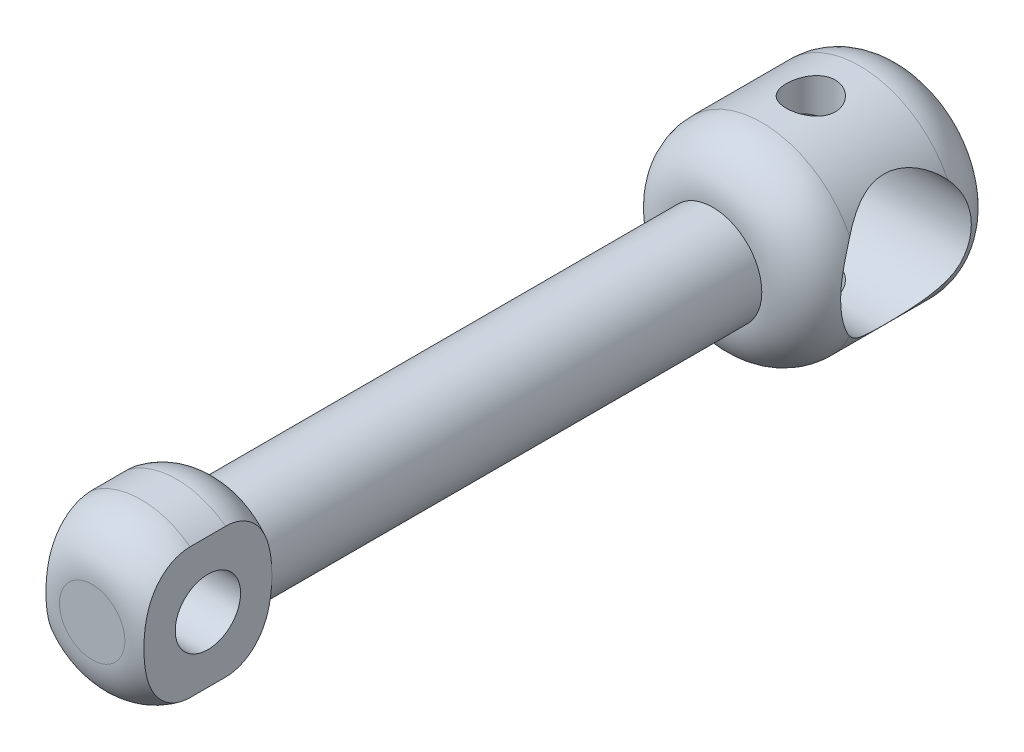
ISO-10303-21;
HEADER;
FILE_DESCRIPTION(('STEP AP214'),'2;1');
FILE_NAME('part.step','',(''),(''),'','','');
FILE_SCHEMA(('AUTOMOTIVE_DESIGN { 1 0 10303 214 1 1 1 1 }'));
ENDSEC;
DATA;
#1=APPLICATION_CONTEXT('core data for automotive mechanical design processes');
#2=APPLICATION_PROTOCOL_DEFINITION('international standard','automotive_design',2000,#1);
#3=PRODUCT_CONTEXT('',#1,'mechanical');
#4=PRODUCT('Part','Part','',(#3));
#5=PRODUCT_RELATED_PRODUCT_CATEGORY('part','',(#4));
#6=PRODUCT_DEFINITION_FORMATION('','',#4);
#7=PRODUCT_DEFINITION_CONTEXT('part definition',#1,'design');
#8=PRODUCT_DEFINITION('design','',#6,#7);
#9=PRODUCT_DEFINITION_SHAPE('','',#8);
#10=(LENGTH_UNIT() NAMED_UNIT(*) SI_UNIT(.MILLI.,.METRE.));
#11=(NAMED_UNIT(*) PLANE_ANGLE_UNIT() SI_UNIT($,.RADIAN.));
#12=(NAMED_UNIT(*) SI_UNIT($,.STERADIAN.) SOLID_ANGLE_UNIT());
#13=UNCERTAINTY_MEASURE_WITH_UNIT(LENGTH_MEASURE(1.E-05),#10,'distance_accuracy_value','');
#14=(GEOMETRIC_REPRESENTATION_CONTEXT(3) GLOBAL_UNCERTAINTY_ASSIGNED_CONTEXT((#13)) GLOBAL_UNIT_ASSIGNED_CONTEXT((#10,
#11,#12)) REPRESENTATION_CONTEXT('',''));
#15=CARTESIAN_POINT('',(0.,0.,0.));
#16=DIRECTION('',(0.,0.,1.));
#17=DIRECTION('',(1.,0.,0.));
#18=AXIS2_PLACEMENT_3D('',#15,#16,#17);
#19=CARTESIAN_POINT('',(0.,0.,12.));
#20=DIRECTION('',(0.,0.,-1.));
#21=DIRECTION('',(-1.,0.,0.));
#22=AXIS2_PLACEMENT_3D('',#19,#20,#21);
#23=CYLINDRICAL_SURFACE('',#22,6.);
#24=CARTESIAN_POINT('',(0.,6.,7.5));
#25=CARTESIAN_POINT('',(-0.0828760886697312,5.99999859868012,7.49999767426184));
#26=CARTESIAN_POINT('',(-0.165778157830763,5.99826578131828,7.49310844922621));
#27=CARTESIAN_POINT('',(-0.329206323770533,5.99152113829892,7.465774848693));
#28=CARTESIAN_POINT('',(-0.40973104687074,5.98650745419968,7.44532279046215));
#29=CARTESIAN_POINT('',(-0.566020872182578,5.9737562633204,7.39156074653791));
#30=CARTESIAN_POINT('',(-0.641791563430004,5.96602202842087,7.35826620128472));
#31=CARTESIAN_POINT('',(-0.786672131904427,5.94865343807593,7.27981860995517));
#32=CARTESIAN_POINT('',(-0.85578178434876,5.9390190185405,7.23466516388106));
#33=CARTESIAN_POINT('',(-0.98680192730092,5.91867413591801,7.13279921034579));
#34=CARTESIAN_POINT('',(-1.04855569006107,5.90794707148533,7.07588842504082));
#35=CARTESIAN_POINT('',(-1.1617489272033,5.8867362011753,6.95254779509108));
#36=CARTESIAN_POINT('',(-1.21318723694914,5.87625242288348,6.8861168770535));
#37=CARTESIAN_POINT('',(-1.30502654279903,5.8565477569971,6.74440477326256));
#38=CARTESIAN_POINT('',(-1.34525221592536,5.84734794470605,6.6690067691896));
#39=CARTESIAN_POINT('',(-1.41239690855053,5.83149494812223,6.51225158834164));
#40=CARTESIAN_POINT('',(-1.43931805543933,5.82484135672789,6.43089536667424));
#41=CARTESIAN_POINT('',(-1.47855483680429,5.81500476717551,6.26625650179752));
#42=CARTESIAN_POINT('',(-1.49115226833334,5.81175491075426,6.1830451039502));
#43=CARTESIAN_POINT('',(-1.50226177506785,5.80889362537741,6.01563143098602));
#44=CARTESIAN_POINT('',(-1.50077614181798,5.80928160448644,5.93142931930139));
#45=CARTESIAN_POINT('',(-1.48398652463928,5.81359205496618,5.76658419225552));
#46=CARTESIAN_POINT('',(-1.46901834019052,5.81742863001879,5.6859043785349));
#47=CARTESIAN_POINT('',(-1.42622418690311,5.82806709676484,5.52823894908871));
#48=CARTESIAN_POINT('',(-1.39839730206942,5.83486919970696,5.45125359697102));
#49=CARTESIAN_POINT('',(-1.33038947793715,5.85075113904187,5.30226198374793));
#50=CARTESIAN_POINT('',(-1.29008666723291,5.85985327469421,5.23031382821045));
#51=CARTESIAN_POINT('',(-1.19835627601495,5.87929710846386,5.09408129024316));
#52=CARTESIAN_POINT('',(-1.14692674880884,5.88963902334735,5.02979825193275));
#53=CARTESIAN_POINT('',(-1.03266342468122,5.91075880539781,4.9087963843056));
#54=CARTESIAN_POINT('',(-0.96954625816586,5.92154069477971,4.85234550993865));
#55=CARTESIAN_POINT('',(-0.8346119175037,5.94205965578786,4.7507787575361));
#56=CARTESIAN_POINT('',(-0.762794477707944,5.95179669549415,4.70566322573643));
#57=CARTESIAN_POINT('',(-0.612115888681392,5.96917732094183,4.62794941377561));
#58=CARTESIAN_POINT('',(-0.533231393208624,5.97681360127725,4.59539465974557));
#59=CARTESIAN_POINT('',(-0.370876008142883,5.98907916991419,4.54408269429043));
#60=CARTESIAN_POINT('',(-0.287405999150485,5.99370903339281,4.52532284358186));
#61=CARTESIAN_POINT('',(-0.120539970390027,5.99935499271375,4.50254243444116));
#62=CARTESIAN_POINT('',(-0.0371967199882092,6.00046053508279,4.4981569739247));
#63=CARTESIAN_POINT('',(0.129032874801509,5.99918804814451,4.50324900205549));
#64=CARTESIAN_POINT('',(0.211919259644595,5.99681033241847,4.51272524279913));
#65=CARTESIAN_POINT('',(0.373614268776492,5.98889581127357,4.54497090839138));
#66=CARTESIAN_POINT('',(0.452465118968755,5.98340634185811,4.56754126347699));
#67=CARTESIAN_POINT('',(0.605257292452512,5.96988706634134,4.62510708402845));
#68=CARTESIAN_POINT('',(0.679198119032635,5.96185700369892,4.66010380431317));
#69=CARTESIAN_POINT('',(0.821523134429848,5.94393307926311,4.74223612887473));
#70=CARTESIAN_POINT('',(0.889785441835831,5.93400867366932,4.78957611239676));
#71=CARTESIAN_POINT('',(1.01752661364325,5.91344509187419,4.89478990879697));
#72=CARTESIAN_POINT('',(1.07700395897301,5.90280579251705,4.95266553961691));
#73=CARTESIAN_POINT('',(1.18699056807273,5.88168956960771,5.07900196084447));
#74=CARTESIAN_POINT('',(1.23724386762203,5.87122304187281,5.14768770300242));
#75=CARTESIAN_POINT('',(1.3255107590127,5.85192878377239,5.29273263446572));
#76=CARTESIAN_POINT('',(1.36352489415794,5.84310098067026,5.36909148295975));
#77=CARTESIAN_POINT('',(1.42595142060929,5.82818094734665,5.52690572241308));
#78=CARTESIAN_POINT('',(1.45044439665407,5.82207255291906,5.60832762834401));
#79=CARTESIAN_POINT('',(1.48534565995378,5.81326744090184,5.77430963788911));
#80=CARTESIAN_POINT('',(1.49575702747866,5.81056997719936,5.85886905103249));
#81=CARTESIAN_POINT('',(1.50203859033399,5.80894901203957,6.0261210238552));
#82=CARTESIAN_POINT('',(1.49831789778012,5.80991932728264,6.10879743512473));
#83=CARTESIAN_POINT('',(1.47737727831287,5.81527909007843,6.27230388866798));
#84=CARTESIAN_POINT('',(1.46015762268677,5.81966846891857,6.35313396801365));
#85=CARTESIAN_POINT('',(1.41293131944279,5.83131260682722,6.51020845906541));
#86=CARTESIAN_POINT('',(1.38300140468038,5.83855015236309,6.58647730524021));
#87=CARTESIAN_POINT('',(1.31126491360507,5.85507755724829,6.73296538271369));
#88=CARTESIAN_POINT('',(1.26945669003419,5.86436770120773,6.80318377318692));
#89=CARTESIAN_POINT('',(1.17386774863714,5.88425634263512,6.93755462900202));
#90=CARTESIAN_POINT('',(1.11980316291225,5.89488264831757,7.00150107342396));
#91=CARTESIAN_POINT('',(1.00178937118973,5.91608027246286,7.11954704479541));
#92=CARTESIAN_POINT('',(0.937837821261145,5.9266515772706,7.17364423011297));
#93=CARTESIAN_POINT('',(0.80046758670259,5.94677655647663,7.27141130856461));
#94=CARTESIAN_POINT('',(0.726898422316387,5.95630833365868,7.31487461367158));
#95=CARTESIAN_POINT('',(0.573266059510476,5.97304924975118,7.38874746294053));
#96=CARTESIAN_POINT('',(0.493207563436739,5.98026005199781,7.41916636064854));
#97=CARTESIAN_POINT('',(0.344410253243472,5.99048059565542,7.46157183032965));
#98=CARTESIAN_POINT('',(0.276380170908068,5.99402585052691,7.47595124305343));
#99=CARTESIAN_POINT('',(0.138906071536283,5.99878605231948,7.49516594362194));
#100=CARTESIAN_POINT('',(0.0694621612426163,6.00000117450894,7.5000019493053));
#101=CARTESIAN_POINT('',(0.,6.,7.5));
#102=B_SPLINE_CURVE_WITH_KNOTS('',3,(#24,#25,#26,#27,#28,#29,#30,#31,#32,#33,#34,#35,#36,#37,
#38,#39,#40,#41,#42,#43,#44,#45,#46,#47,#48,#49,#50,#51,#52,#53,#54,#55,#56,#57,#58,#59,#60,#61,
#62,#63,#64,#65,#66,#67,#68,#69,#70,#71,#72,#73,#74,#75,#76,#77,#78,#79,#80,#81,#82,#83,#84,#85,
#86,#87,#88,#89,#90,#91,#92,#93,#94,#95,#96,#97,#98,#99,#100,#101),.UNSPECIFIED.,.T.,.F.,(4,2,2,
2,2,2,2,2,2,2,2,2,2,2,2,2,2,2,2,2,2,2,2,2,2,2,2,2,2,2,2,2,2,2,2,2,2,2,4),(0.,0.24837371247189,
0.4968882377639,0.745104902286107,0.993329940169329,1.24614435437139,1.49898729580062,
1.75558647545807,2.01214461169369,2.2635629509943,2.51494038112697,2.76022497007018,
3.00552703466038,3.25330527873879,3.50112690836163,3.75601500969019,4.01091089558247,
4.26668229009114,4.52240473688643,4.77158308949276,5.02073901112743,5.26620274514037,
5.51169127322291,5.76153587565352,6.01142363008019,6.26744509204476,6.52345518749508,
6.77792254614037,7.03233423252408,7.27943780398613,7.52653640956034,7.77216400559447,
8.01782568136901,8.2698957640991,8.52202569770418,8.77872185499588,9.0352336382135,
9.24342242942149,9.45159556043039),.UNSPECIFIED.);
#103=CARTESIAN_POINT('',(0.,6.,7.5));
#104=VERTEX_POINT('',#103);
#105=EDGE_CURVE('E127',#104,#104,#102,.T.);
#106=ORIENTED_EDGE('',*,*,#105,.T.);
#107=EDGE_LOOP('',(#106));
#108=FACE_BOUND('',#107,.T.);
#109=CARTESIAN_POINT('',(0.,0.,9.));
#110=DIRECTION('',(0.,0.,1.));
#111=DIRECTION('',(1.,0.,0.));
#112=AXIS2_PLACEMENT_3D('',#109,#110,#111);
#113=CIRCLE('',#112,6.);
#114=CARTESIAN_POINT('',(-5.38516480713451,2.64575131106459,9.));
#115=VERTEX_POINT('',#114);
#116=CARTESIAN_POINT('',(5.3851648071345,2.64575131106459,9.));
#117=VERTEX_POINT('',#116);
#118=EDGE_CURVE('E124',#115,#117,#113,.F.);
#119=ORIENTED_EDGE('',*,*,#118,.T.);
#120=CARTESIAN_POINT('',(5.3851648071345,2.64575131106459,9.));
#121=CARTESIAN_POINT('',(5.34267944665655,2.73224832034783,8.92369848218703));
#122=CARTESIAN_POINT('',(5.29932246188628,2.8152098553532,8.84389915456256));
#123=CARTESIAN_POINT('',(5.21195354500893,2.97383814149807,8.67759732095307));
#124=CARTESIAN_POINT('',(5.16794130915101,3.04950137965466,8.59109162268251));
#125=CARTESIAN_POINT('',(5.08002559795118,3.19382904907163,8.41099053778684));
#126=CARTESIAN_POINT('',(5.03612613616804,3.26242940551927,8.31734173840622));
#127=CARTESIAN_POINT('',(4.95010283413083,3.39153414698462,8.12391585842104));
#128=CARTESIAN_POINT('',(4.9079785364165,3.45204062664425,8.02414037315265));
#129=CARTESIAN_POINT('',(4.80043198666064,3.60124038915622,7.75170975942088));
#130=CARTESIAN_POINT('',(4.73768622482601,3.68265478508,7.57387891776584));
#131=CARTESIAN_POINT('',(4.62814737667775,3.8194222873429,7.2044012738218));
#132=CARTESIAN_POINT('',(4.58129554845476,3.8748716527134,7.01280858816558));
#133=CARTESIAN_POINT('',(4.5162631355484,3.95037533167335,6.65048027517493));
#134=CARTESIAN_POINT('',(4.49471725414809,3.97464407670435,6.48124607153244));
#135=CARTESIAN_POINT('',(4.47108389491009,4.00122012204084,6.13971313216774));
#136=CARTESIAN_POINT('',(4.4689863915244,4.0035387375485,5.9674160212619));
#137=CARTESIAN_POINT('',(4.48456367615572,3.98607584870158,5.62508090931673));
#138=CARTESIAN_POINT('',(4.50221804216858,3.96631717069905,5.45504075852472));
#139=CARTESIAN_POINT('',(4.55463958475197,3.90599696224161,5.12134749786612));
#140=CARTESIAN_POINT('',(4.58942986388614,3.86540734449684,4.95770333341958));
#141=CARTESIAN_POINT('',(4.68492255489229,3.74949807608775,4.58954307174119));
#142=CARTESIAN_POINT('',(4.75033898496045,3.66725730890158,4.38844914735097));
#143=CARTESIAN_POINT('',(4.89354018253,3.47386266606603,4.00538863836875));
#144=CARTESIAN_POINT('',(4.97134543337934,3.36266070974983,3.82345457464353));
#145=CARTESIAN_POINT('',(5.10660278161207,3.15170305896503,3.53249820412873));
#146=CARTESIAN_POINT('',(5.16308910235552,3.05866668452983,3.41807228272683));
#147=CARTESIAN_POINT('',(5.27524637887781,2.86089006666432,3.2005850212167));
#148=CARTESIAN_POINT('',(5.33091999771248,2.75621058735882,3.0974697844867));
#149=CARTESIAN_POINT('',(5.38516480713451,2.64575131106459,3.));
#150=B_SPLINE_CURVE_WITH_KNOTS('',3,(#120,#121,#122,#123,#124,#125,#126,#127,#128,#129,#130,
#131,#132,#133,#134,#135,#136,#137,#138,#139,#140,#141,#142,#143,#144,#145,#146,#147,#148,#149),
.UNSPECIFIED.,.F.,.F.,(4,2,2,2,2,2,2,2,2,2,2,2,2,2,4),(0.,0.36862550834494,0.737427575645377,
1.10932517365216,1.48112634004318,2.09486559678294,2.70631119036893,3.22093429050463,
3.73529209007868,4.24911857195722,4.7636396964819,5.44072359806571,6.11893882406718,
6.59191937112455,7.06253805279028),.UNSPECIFIED.);
#151=CARTESIAN_POINT('',(5.3851648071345,2.64575131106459,3.));
#152=VERTEX_POINT('',#151);
#153=EDGE_CURVE('E55',#117,#152,#150,.T.);
#154=ORIENTED_EDGE('',*,*,#153,.T.);
#155=CARTESIAN_POINT('',(0.,0.,3.));
#156=DIRECTION('',(0.,0.,1.));
#157=DIRECTION('',(1.,0.,0.));
#158=AXIS2_PLACEMENT_3D('',#155,#156,#157);
#159=CIRCLE('',#158,6.);
#160=CARTESIAN_POINT('',(-5.3851648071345,2.64575131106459,3.));
#161=VERTEX_POINT('',#160);
#162=EDGE_CURVE('E126',#152,#161,#159,.T.);
#163=ORIENTED_EDGE('',*,*,#162,.T.);
#164=CARTESIAN_POINT('',(-5.3851648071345,2.64575131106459,3.));
#165=CARTESIAN_POINT('',(-5.34267944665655,2.73224832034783,3.07630151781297));
#166=CARTESIAN_POINT('',(-5.29932246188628,2.8152098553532,3.15610084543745));
#167=CARTESIAN_POINT('',(-5.21195354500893,2.97383814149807,3.32240267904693));
#168=CARTESIAN_POINT('',(-5.16794130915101,3.04950137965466,3.40890837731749));
#169=CARTESIAN_POINT('',(-5.08002559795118,3.19382904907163,3.58900946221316));
#170=CARTESIAN_POINT('',(-5.03612613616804,3.26242940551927,3.68265826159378));
#171=CARTESIAN_POINT('',(-4.95010283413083,3.39153414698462,3.87608414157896));
#172=CARTESIAN_POINT('',(-4.9079785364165,3.45204062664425,3.97585962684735));
#173=CARTESIAN_POINT('',(-4.80043198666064,3.60124038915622,4.24829024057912));
#174=CARTESIAN_POINT('',(-4.73768622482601,3.68265478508,4.42612108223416));
#175=CARTESIAN_POINT('',(-4.62814737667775,3.8194222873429,4.7955987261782));
#176=CARTESIAN_POINT('',(-4.58129554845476,3.8748716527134,4.98719141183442));
#177=CARTESIAN_POINT('',(-4.5162631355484,3.95037533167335,5.34951972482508));
#178=CARTESIAN_POINT('',(-4.49471725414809,3.97464407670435,5.51875392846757));
#179=CARTESIAN_POINT('',(-4.47108389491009,4.00122012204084,5.86028686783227));
#180=CARTESIAN_POINT('',(-4.46898639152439,4.0035387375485,6.0325839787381));
#181=CARTESIAN_POINT('',(-4.48456367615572,3.98607584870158,6.37491909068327));
#182=CARTESIAN_POINT('',(-4.50221804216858,3.96631717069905,6.54495924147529));
#183=CARTESIAN_POINT('',(-4.55463958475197,3.90599696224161,6.87865250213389));
#184=CARTESIAN_POINT('',(-4.58942986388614,3.86540734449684,7.04229666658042));
#185=CARTESIAN_POINT('',(-4.68492255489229,3.74949807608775,7.41045692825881));
#186=CARTESIAN_POINT('',(-4.75033898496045,3.66725730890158,7.61155085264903));
#187=CARTESIAN_POINT('',(-4.89354018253,3.47386266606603,7.99461136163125));
#188=CARTESIAN_POINT('',(-4.97134543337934,3.36266070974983,8.17654542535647));
#189=CARTESIAN_POINT('',(-5.10660278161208,3.15170305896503,8.46750179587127));
#190=CARTESIAN_POINT('',(-5.16308910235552,3.05866668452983,8.58192771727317));
#191=CARTESIAN_POINT('',(-5.27524637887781,2.86089006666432,8.7994149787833));
#192=CARTESIAN_POINT('',(-5.33091999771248,2.75621058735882,8.9025302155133));
#193=CARTESIAN_POINT('',(-5.38516480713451,2.64575131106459,9.));
#194=B_SPLINE_CURVE_WITH_KNOTS('',3,(#164,#165,#166,#167,#168,#169,#170,#171,#172,#173,#174,
#175,#176,#177,#178,#179,#180,#181,#182,#183,#184,#185,#186,#187,#188,#189,#190,#191,#192,#193),
.UNSPECIFIED.,.F.,.F.,(4,2,2,2,2,2,2,2,2,2,2,2,2,2,4),(0.,0.36862550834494,0.737427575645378,
1.10932517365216,1.48112634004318,2.09486559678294,2.70631119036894,3.22093429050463,
3.73529209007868,4.24911857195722,4.7636396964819,5.44072359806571,6.11893882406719,
6.59191937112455,7.06253805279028),.UNSPECIFIED.);
#195=EDGE_CURVE('E113',#161,#115,#194,.T.);
#196=ORIENTED_EDGE('',*,*,#195,.T.);
#197=EDGE_LOOP('',(#119,#154,#163,#196));
#198=FACE_BOUND('',#197,.T.);
#199=ADVANCED_FACE('F34',(#108,#198),#23,.T.);
#200=CARTESIAN_POINT('',(0.,0.,50.));
#201=DIRECTION('',(0.,0.,-1.));
#202=DIRECTION('',(-1.,0.,0.));
#203=AXIS2_PLACEMENT_3D('',#200,#201,#202);
#204=CYLINDRICAL_SURFACE('',#203,5.);
#205=DIRECTION('',(0.,0.,-1.));
#206=VECTOR('',#205,1.);
#207=CARTESIAN_POINT('',(-3.,4.,50.));
#208=LINE('',#207,#206);
#209=CARTESIAN_POINT('',(-3.,4.,47.));
#210=VERTEX_POINT('',#209);
#211=CARTESIAN_POINT('',(-3.,4.,44.8284271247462));
#212=VERTEX_POINT('',#211);
#213=EDGE_CURVE('E462',#210,#212,#208,.T.);
#214=ORIENTED_EDGE('',*,*,#213,.F.);
#215=CARTESIAN_POINT('',(0.,0.,47.));
#216=DIRECTION('',(0.,0.,1.));
#217=DIRECTION('',(1.,0.,0.));
#218=AXIS2_PLACEMENT_3D('',#215,#216,#217);
#219=CIRCLE('',#218,5.);
#220=CARTESIAN_POINT('',(3.,4.,47.));
#221=VERTEX_POINT('',#220);
#222=EDGE_CURVE('E152',#210,#221,#219,.F.);
#223=ORIENTED_EDGE('',*,*,#222,.T.);
#224=DIRECTION('',(0.,0.,-1.));
#225=VECTOR('',#224,1.);
#226=CARTESIAN_POINT('',(3.,4.,50.));
#227=LINE('',#226,#225);
#228=CARTESIAN_POINT('',(3.,4.,44.8284271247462));
#229=VERTEX_POINT('',#228);
#230=EDGE_CURVE('E448',#229,#221,#227,.F.);
#231=ORIENTED_EDGE('',*,*,#230,.F.);
#232=CARTESIAN_POINT('',(0.,0.,44.8284271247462));
#233=DIRECTION('',(0.,0.,-1.));
#234=DIRECTION('',(-1.,0.,0.));
#235=AXIS2_PLACEMENT_3D('',#232,#233,#234);
#236=CIRCLE('',#235,5.);
#237=EDGE_CURVE('E149',#229,#212,#236,.F.);
#238=ORIENTED_EDGE('',*,*,#237,.T.);
#239=EDGE_LOOP('',(#214,#223,#231,#238));
#240=FACE_BOUND('',#239,.T.);
#241=ADVANCED_FACE('F304',(#240),#204,.T.);
#242=DIRECTION('',(0.,0.,-1.));
#243=VECTOR('',#242,1.);
#244=CARTESIAN_POINT('',(3.,-4.,50.));
#245=LINE('',#244,#243);
#246=CARTESIAN_POINT('',(3.,-4.,47.));
#247=VERTEX_POINT('',#246);
#248=CARTESIAN_POINT('',(3.,-4.,44.8284271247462));
#249=VERTEX_POINT('',#248);
#250=EDGE_CURVE('E440',#247,#249,#245,.T.);
#251=ORIENTED_EDGE('',*,*,#250,.F.);
#252=CARTESIAN_POINT('',(0.,0.,47.));
#253=DIRECTION('',(0.,0.,-1.));
#254=DIRECTION('',(-1.,0.,0.));
#255=AXIS2_PLACEMENT_3D('',#252,#253,#254);
#256=CIRCLE('',#255,5.);
#257=CARTESIAN_POINT('',(-3.,-4.,47.));
#258=VERTEX_POINT('',#257);
#259=EDGE_CURVE('E443',#247,#258,#256,.T.);
#260=ORIENTED_EDGE('',*,*,#259,.T.);
#261=DIRECTION('',(0.,0.,-1.));
#262=VECTOR('',#261,1.);
#263=CARTESIAN_POINT('',(-3.,-4.,50.));
#264=LINE('',#263,#262);
#265=CARTESIAN_POINT('',(-3.,-4.,44.8284271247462));
#266=VERTEX_POINT('',#265);
#267=EDGE_CURVE('E447',#266,#258,#264,.F.);
#268=ORIENTED_EDGE('',*,*,#267,.F.);
#269=CARTESIAN_POINT('',(0.,0.,44.8284271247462));
#270=DIRECTION('',(0.,0.,-1.));
#271=DIRECTION('',(-1.,0.,0.));
#272=AXIS2_PLACEMENT_3D('',#269,#270,#271);
#273=CIRCLE('',#272,5.);
#274=EDGE_CURVE('E186',#266,#249,#273,.F.);
#275=ORIENTED_EDGE('',*,*,#274,.T.);
#276=EDGE_LOOP('',(#251,#260,#268,#275));
#277=FACE_BOUND('',#276,.T.);
#278=ADVANCED_FACE('F309',(#277),#204,.T.);
#279=CARTESIAN_POINT('',(0.,0.,50.));
#280=DIRECTION('',(0.,0.,1.));
#281=DIRECTION('',(1.,0.,0.));
#282=AXIS2_PLACEMENT_3D('',#279,#280,#281);
#283=PLANE('',#282);
#284=CARTESIAN_POINT('',(0.,0.,50.));
#285=DIRECTION('',(0.,0.,1.));
#286=DIRECTION('',(1.,0.,0.));
#287=AXIS2_PLACEMENT_3D('',#284,#285,#286);
#288=CIRCLE('',#287,2.);
#289=CARTESIAN_POINT('',(1.2,1.6,50.));
#290=VERTEX_POINT('',#289);
#291=EDGE_CURVE('E146',#290,#290,#288,.T.);
#292=ORIENTED_EDGE('',*,*,#291,.T.);
#293=EDGE_LOOP('',(#292));
#294=FACE_BOUND('',#293,.T.);
#295=ADVANCED_FACE('F176',(#294),#283,.T.);
#296=CARTESIAN_POINT('',(0.,-6.,7.5));
#297=CARTESIAN_POINT('',(0.0828760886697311,-5.99999859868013,7.49999767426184));
#298=CARTESIAN_POINT('',(0.165778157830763,-5.99826578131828,7.49310844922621));
#299=CARTESIAN_POINT('',(0.329206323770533,-5.99152113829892,7.465774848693));
#300=CARTESIAN_POINT('',(0.409731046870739,-5.98650745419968,7.44532279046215));
#301=CARTESIAN_POINT('',(0.566020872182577,-5.9737562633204,7.39156074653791));
#302=CARTESIAN_POINT('',(0.641791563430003,-5.96602202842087,7.35826620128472));
#303=CARTESIAN_POINT('',(0.786672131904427,-5.94865343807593,7.27981860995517));
#304=CARTESIAN_POINT('',(0.855781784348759,-5.9390190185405,7.23466516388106));
#305=CARTESIAN_POINT('',(0.98680192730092,-5.91867413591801,7.13279921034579));
#306=CARTESIAN_POINT('',(1.04855569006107,-5.90794707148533,7.07588842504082));
#307=CARTESIAN_POINT('',(1.1617489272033,-5.8867362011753,6.95254779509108));
#308=CARTESIAN_POINT('',(1.21318723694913,-5.87625242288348,6.8861168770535));
#309=CARTESIAN_POINT('',(1.30502654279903,-5.8565477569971,6.74440477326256));
#310=CARTESIAN_POINT('',(1.34525221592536,-5.84734794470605,6.6690067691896));
#311=CARTESIAN_POINT('',(1.41239690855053,-5.83149494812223,6.51225158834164));
#312=CARTESIAN_POINT('',(1.43931805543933,-5.82484135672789,6.43089536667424));
#313=CARTESIAN_POINT('',(1.47855483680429,-5.81500476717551,6.26625650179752));
#314=CARTESIAN_POINT('',(1.49115226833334,-5.81175491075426,6.1830451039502));
#315=CARTESIAN_POINT('',(1.50226177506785,-5.80889362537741,6.01563143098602));
#316=CARTESIAN_POINT('',(1.50077614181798,-5.80928160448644,5.93142931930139));
#317=CARTESIAN_POINT('',(1.48398652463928,-5.81359205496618,5.76658419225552));
#318=CARTESIAN_POINT('',(1.46901834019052,-5.81742863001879,5.6859043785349));
#319=CARTESIAN_POINT('',(1.42622418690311,-5.82806709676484,5.52823894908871));
#320=CARTESIAN_POINT('',(1.39839730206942,-5.83486919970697,5.45125359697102));
#321=CARTESIAN_POINT('',(1.33038947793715,-5.85075113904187,5.30226198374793));
#322=CARTESIAN_POINT('',(1.29008666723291,-5.85985327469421,5.23031382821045));
#323=CARTESIAN_POINT('',(1.19835627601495,-5.87929710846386,5.09408129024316));
#324=CARTESIAN_POINT('',(1.14692674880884,-5.88963902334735,5.02979825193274));
#325=CARTESIAN_POINT('',(1.03266342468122,-5.91075880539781,4.9087963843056));
#326=CARTESIAN_POINT('',(0.96954625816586,-5.92154069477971,4.85234550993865));
#327=CARTESIAN_POINT('',(0.8346119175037,-5.94205965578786,4.7507787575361));
#328=CARTESIAN_POINT('',(0.762794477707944,-5.95179669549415,4.70566322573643));
#329=CARTESIAN_POINT('',(0.612115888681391,-5.96917732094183,4.62794941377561));
#330=CARTESIAN_POINT('',(0.533231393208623,-5.97681360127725,4.59539465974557));
#331=CARTESIAN_POINT('',(0.370876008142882,-5.98907916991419,4.54408269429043));
#332=CARTESIAN_POINT('',(0.287405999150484,-5.99370903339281,4.52532284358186));
#333=CARTESIAN_POINT('',(0.120539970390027,-5.99935499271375,4.50254243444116));
#334=CARTESIAN_POINT('',(0.0371967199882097,-6.00046053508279,4.4981569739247));
#335=CARTESIAN_POINT('',(-0.129032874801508,-5.99918804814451,4.50324900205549));
#336=CARTESIAN_POINT('',(-0.211919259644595,-5.99681033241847,4.51272524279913));
#337=CARTESIAN_POINT('',(-0.373614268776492,-5.98889581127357,4.54497090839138));
#338=CARTESIAN_POINT('',(-0.452465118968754,-5.98340634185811,4.56754126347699));
#339=CARTESIAN_POINT('',(-0.605257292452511,-5.96988706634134,4.62510708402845));
#340=CARTESIAN_POINT('',(-0.679198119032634,-5.96185700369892,4.66010380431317));
#341=CARTESIAN_POINT('',(-0.821523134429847,-5.94393307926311,4.74223612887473));
#342=CARTESIAN_POINT('',(-0.88978544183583,-5.93400867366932,4.78957611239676));
#343=CARTESIAN_POINT('',(-1.01752661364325,-5.91344509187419,4.89478990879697));
#344=CARTESIAN_POINT('',(-1.07700395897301,-5.90280579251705,4.95266553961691));
#345=CARTESIAN_POINT('',(-1.18699056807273,-5.88168956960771,5.07900196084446));
#346=CARTESIAN_POINT('',(-1.23724386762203,-5.87122304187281,5.14768770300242));
#347=CARTESIAN_POINT('',(-1.3255107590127,-5.85192878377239,5.29273263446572));
#348=CARTESIAN_POINT('',(-1.36352489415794,-5.84310098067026,5.36909148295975));
#349=CARTESIAN_POINT('',(-1.42595142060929,-5.82818094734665,5.52690572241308));
#350=CARTESIAN_POINT('',(-1.45044439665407,-5.82207255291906,5.60832762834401));
#351=CARTESIAN_POINT('',(-1.48534565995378,-5.81326744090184,5.77430963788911));
#352=CARTESIAN_POINT('',(-1.49575702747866,-5.81056997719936,5.85886905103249));
#353=CARTESIAN_POINT('',(-1.50203859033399,-5.80894901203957,6.0261210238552));
#354=CARTESIAN_POINT('',(-1.49831789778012,-5.80991932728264,6.10879743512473));
#355=CARTESIAN_POINT('',(-1.47737727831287,-5.81527909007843,6.27230388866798));
#356=CARTESIAN_POINT('',(-1.46015762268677,-5.81966846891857,6.35313396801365));
#357=CARTESIAN_POINT('',(-1.41293131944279,-5.83131260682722,6.51020845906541));
#358=CARTESIAN_POINT('',(-1.38300140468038,-5.83855015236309,6.58647730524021));
#359=CARTESIAN_POINT('',(-1.31126491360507,-5.85507755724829,6.73296538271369));
#360=CARTESIAN_POINT('',(-1.26945669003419,-5.86436770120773,6.80318377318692));
#361=CARTESIAN_POINT('',(-1.17386774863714,-5.88425634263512,6.93755462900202));
#362=CARTESIAN_POINT('',(-1.11980316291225,-5.89488264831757,7.00150107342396));
#363=CARTESIAN_POINT('',(-1.00178937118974,-5.91608027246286,7.11954704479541));
#364=CARTESIAN_POINT('',(-0.937837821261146,-5.9266515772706,7.17364423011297));
#365=CARTESIAN_POINT('',(-0.80046758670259,-5.94677655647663,7.27141130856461));
#366=CARTESIAN_POINT('',(-0.726898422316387,-5.95630833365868,7.31487461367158));
#367=CARTESIAN_POINT('',(-0.573266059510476,-5.97304924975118,7.38874746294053));
#368=CARTESIAN_POINT('',(-0.493207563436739,-5.98026005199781,7.41916636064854));
#369=CARTESIAN_POINT('',(-0.344410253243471,-5.99048059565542,7.46157183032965));
#370=CARTESIAN_POINT('',(-0.276380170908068,-5.99402585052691,7.47595124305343));
#371=CARTESIAN_POINT('',(-0.138906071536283,-5.99878605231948,7.49516594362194));
#372=CARTESIAN_POINT('',(-0.0694621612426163,-6.00000117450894,7.5000019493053));
#373=CARTESIAN_POINT('',(0.,-6.,7.5));
#374=B_SPLINE_CURVE_WITH_KNOTS('',3,(#296,#297,#298,#299,#300,#301,#302,#303,#304,#305,#306,
#307,#308,#309,#310,#311,#312,#313,#314,#315,#316,#317,#318,#319,#320,#321,#322,#323,#324,#325,
#326,#327,#328,#329,#330,#331,#332,#333,#334,#335,#336,#337,#338,#339,#340,#341,#342,#343,#344,
#345,#346,#347,#348,#349,#350,#351,#352,#353,#354,#355,#356,#357,#358,#359,#360,#361,#362,#363,
#364,#365,#366,#367,#368,#369,#370,#371,#372,#373),.UNSPECIFIED.,.T.,.F.,(4,2,2,2,2,2,2,2,2,2,2,
2,2,2,2,2,2,2,2,2,2,2,2,2,2,2,2,2,2,2,2,2,2,2,2,2,2,2,4),(0.,0.24837371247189,0.4968882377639,
0.745104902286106,0.993329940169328,1.24614435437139,1.49898729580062,1.75558647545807,
2.01214461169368,2.2635629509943,2.51494038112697,2.76022497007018,3.00552703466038,
3.25330527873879,3.50112690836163,3.75601500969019,4.01091089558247,4.26668229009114,
4.52240473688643,4.77158308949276,5.02073901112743,5.26620274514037,5.5116912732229,
5.76153587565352,6.01142363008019,6.26744509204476,6.52345518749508,6.77792254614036,
7.03233423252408,7.27943780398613,7.52653640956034,7.77216400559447,8.01782568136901,
8.2698957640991,8.52202569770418,8.77872185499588,9.0352336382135,9.24342242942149,
9.4515955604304),.UNSPECIFIED.);
#375=CARTESIAN_POINT('',(0.,-6.,7.5));
#376=VERTEX_POINT('',#375);
#377=EDGE_CURVE('E269',#376,#376,#374,.T.);
#378=ORIENTED_EDGE('',*,*,#377,.T.);
#379=EDGE_LOOP('',(#378));
#380=FACE_BOUND('',#379,.T.);
#381=CARTESIAN_POINT('',(5.38516480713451,-2.64575131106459,9.));
#382=VERTEX_POINT('',#381);
#383=CARTESIAN_POINT('',(-5.3851648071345,-2.64575131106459,9.));
#384=VERTEX_POINT('',#383);
#385=EDGE_CURVE('E131',#382,#384,#113,.F.);
#386=ORIENTED_EDGE('',*,*,#385,.T.);
#387=CARTESIAN_POINT('',(-5.3851648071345,-2.64575131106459,9.));
#388=CARTESIAN_POINT('',(-5.34267944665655,-2.73224832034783,8.92369848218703));
#389=CARTESIAN_POINT('',(-5.29932246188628,-2.8152098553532,8.84389915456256));
#390=CARTESIAN_POINT('',(-5.21195354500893,-2.97383814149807,8.67759732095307));
#391=CARTESIAN_POINT('',(-5.16794130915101,-3.04950137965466,8.59109162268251));
#392=CARTESIAN_POINT('',(-5.08002559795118,-3.19382904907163,8.41099053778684));
#393=CARTESIAN_POINT('',(-5.03612613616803,-3.26242940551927,8.31734173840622));
#394=CARTESIAN_POINT('',(-4.95010283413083,-3.39153414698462,8.12391585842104));
#395=CARTESIAN_POINT('',(-4.9079785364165,-3.45204062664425,8.02414037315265));
#396=CARTESIAN_POINT('',(-4.80043198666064,-3.60124038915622,7.75170975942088));
#397=CARTESIAN_POINT('',(-4.73768622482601,-3.68265478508,7.57387891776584));
#398=CARTESIAN_POINT('',(-4.62814737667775,-3.8194222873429,7.2044012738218));
#399=CARTESIAN_POINT('',(-4.58129554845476,-3.8748716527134,7.01280858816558));
#400=CARTESIAN_POINT('',(-4.5162631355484,-3.95037533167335,6.65048027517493));
#401=CARTESIAN_POINT('',(-4.49471725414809,-3.97464407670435,6.48124607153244));
#402=CARTESIAN_POINT('',(-4.47108389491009,-4.00122012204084,6.13971313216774));
#403=CARTESIAN_POINT('',(-4.46898639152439,-4.0035387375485,5.9674160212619));
#404=CARTESIAN_POINT('',(-4.48456367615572,-3.98607584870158,5.62508090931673));
#405=CARTESIAN_POINT('',(-4.50221804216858,-3.96631717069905,5.45504075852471));
#406=CARTESIAN_POINT('',(-4.55463958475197,-3.90599696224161,5.12134749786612));
#407=CARTESIAN_POINT('',(-4.58942986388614,-3.86540734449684,4.95770333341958));
#408=CARTESIAN_POINT('',(-4.68492255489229,-3.74949807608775,4.58954307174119));
#409=CARTESIAN_POINT('',(-4.75033898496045,-3.66725730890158,4.38844914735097));
#410=CARTESIAN_POINT('',(-4.89354018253,-3.47386266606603,4.00538863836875));
#411=CARTESIAN_POINT('',(-4.97134543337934,-3.36266070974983,3.82345457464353));
#412=CARTESIAN_POINT('',(-5.10660278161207,-3.15170305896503,3.53249820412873));
#413=CARTESIAN_POINT('',(-5.16308910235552,-3.05866668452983,3.41807228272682));
#414=CARTESIAN_POINT('',(-5.27524637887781,-2.86089006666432,3.2005850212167));
#415=CARTESIAN_POINT('',(-5.33091999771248,-2.75621058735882,3.0974697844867));
#416=CARTESIAN_POINT('',(-5.38516480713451,-2.64575131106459,3.));
#417=B_SPLINE_CURVE_WITH_KNOTS('',3,(#387,#388,#389,#390,#391,#392,#393,#394,#395,#396,#397,
#398,#399,#400,#401,#402,#403,#404,#405,#406,#407,#408,#409,#410,#411,#412,#413,#414,#415,#416),
.UNSPECIFIED.,.F.,.F.,(4,2,2,2,2,2,2,2,2,2,2,2,2,2,4),(0.,0.368625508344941,0.737427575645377,
1.10932517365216,1.48112634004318,2.09486559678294,2.70631119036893,3.22093429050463,
3.73529209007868,4.24911857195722,4.7636396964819,5.44072359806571,6.11893882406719,
6.59191937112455,7.06253805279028),.UNSPECIFIED.);
#418=CARTESIAN_POINT('',(-5.3851648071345,-2.64575131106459,3.));
#419=VERTEX_POINT('',#418);
#420=EDGE_CURVE('E63',#384,#419,#417,.T.);
#421=ORIENTED_EDGE('',*,*,#420,.T.);
#422=CARTESIAN_POINT('',(5.3851648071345,-2.64575131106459,3.));
#423=VERTEX_POINT('',#422);
#424=EDGE_CURVE('E134',#419,#423,#159,.T.);
#425=ORIENTED_EDGE('',*,*,#424,.T.);
#426=CARTESIAN_POINT('',(5.3851648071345,-2.64575131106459,3.));
#427=CARTESIAN_POINT('',(5.34267944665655,-2.73224832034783,3.07630151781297));
#428=CARTESIAN_POINT('',(5.29932246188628,-2.8152098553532,3.15610084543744));
#429=CARTESIAN_POINT('',(5.21195354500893,-2.97383814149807,3.32240267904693));
#430=CARTESIAN_POINT('',(5.16794130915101,-3.04950137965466,3.40890837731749));
#431=CARTESIAN_POINT('',(5.08002559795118,-3.19382904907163,3.58900946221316));
#432=CARTESIAN_POINT('',(5.03612613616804,-3.26242940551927,3.68265826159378));
#433=CARTESIAN_POINT('',(4.95010283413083,-3.39153414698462,3.87608414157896));
#434=CARTESIAN_POINT('',(4.9079785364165,-3.45204062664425,3.97585962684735));
#435=CARTESIAN_POINT('',(4.80043198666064,-3.60124038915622,4.24829024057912));
#436=CARTESIAN_POINT('',(4.73768622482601,-3.68265478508,4.42612108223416));
#437=CARTESIAN_POINT('',(4.62814737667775,-3.8194222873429,4.7955987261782));
#438=CARTESIAN_POINT('',(4.58129554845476,-3.8748716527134,4.98719141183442));
#439=CARTESIAN_POINT('',(4.5162631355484,-3.95037533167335,5.34951972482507));
#440=CARTESIAN_POINT('',(4.49471725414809,-3.97464407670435,5.51875392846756));
#441=CARTESIAN_POINT('',(4.47108389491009,-4.00122012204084,5.86028686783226));
#442=CARTESIAN_POINT('',(4.4689863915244,-4.0035387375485,6.0325839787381));
#443=CARTESIAN_POINT('',(4.48456367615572,-3.98607584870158,6.37491909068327));
#444=CARTESIAN_POINT('',(4.50221804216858,-3.96631717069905,6.54495924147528));
#445=CARTESIAN_POINT('',(4.55463958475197,-3.90599696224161,6.87865250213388));
#446=CARTESIAN_POINT('',(4.58942986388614,-3.86540734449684,7.04229666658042));
#447=CARTESIAN_POINT('',(4.68492255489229,-3.74949807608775,7.41045692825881));
#448=CARTESIAN_POINT('',(4.75033898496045,-3.66725730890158,7.61155085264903));
#449=CARTESIAN_POINT('',(4.89354018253,-3.47386266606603,7.99461136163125));
#450=CARTESIAN_POINT('',(4.97134543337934,-3.36266070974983,8.17654542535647));
#451=CARTESIAN_POINT('',(5.10660278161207,-3.15170305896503,8.46750179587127));
#452=CARTESIAN_POINT('',(5.16308910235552,-3.05866668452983,8.58192771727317));
#453=CARTESIAN_POINT('',(5.27524637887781,-2.86089006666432,8.7994149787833));
#454=CARTESIAN_POINT('',(5.33091999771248,-2.75621058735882,8.9025302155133));
#455=CARTESIAN_POINT('',(5.38516480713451,-2.64575131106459,9.));
#456=B_SPLINE_CURVE_WITH_KNOTS('',3,(#426,#427,#428,#429,#430,#431,#432,#433,#434,#435,#436,
#437,#438,#439,#440,#441,#442,#443,#444,#445,#446,#447,#448,#449,#450,#451,#452,#453,#454,#455),
.UNSPECIFIED.,.F.,.F.,(4,2,2,2,2,2,2,2,2,2,2,2,2,2,4),(0.,0.368625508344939,0.737427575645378,
1.10932517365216,1.48112634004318,2.09486559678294,2.70631119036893,3.22093429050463,
3.73529209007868,4.24911857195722,4.7636396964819,5.44072359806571,6.11893882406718,
6.59191937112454,7.06253805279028),.UNSPECIFIED.);
#457=EDGE_CURVE('E248',#423,#382,#456,.T.);
#458=ORIENTED_EDGE('',*,*,#457,.T.);
#459=EDGE_LOOP('',(#386,#421,#425,#458));
#460=FACE_BOUND('',#459,.T.);
#461=ADVANCED_FACE('F280',(#380,#460),#23,.T.);
#462=CARTESIAN_POINT('',(0.,0.,0.));
#463=DIRECTION('',(0.,0.,1.));
#464=DIRECTION('',(1.,0.,0.));
#465=AXIS2_PLACEMENT_3D('',#462,#463,#464);
#466=PLANE('',#465);
#467=CARTESIAN_POINT('',(0.,0.,0.));
#468=DIRECTION('',(0.,0.,1.));
#469=DIRECTION('',(1.,0.,0.));
#470=AXIS2_PLACEMENT_3D('',#467,#468,#469);
#471=CIRCLE('',#470,3.);
#472=CARTESIAN_POINT('',(3.,0.,0.));
#473=VERTEX_POINT('',#472);
#474=EDGE_CURVE('E143',#473,#473,#471,.F.);
#475=ORIENTED_EDGE('',*,*,#474,.T.);
#476=EDGE_LOOP('',(#475));
#477=FACE_BOUND('',#476,.T.);
#478=ADVANCED_FACE('F284',(#477),#466,.F.);
#479=CARTESIAN_POINT('',(0.,0.,42.));
#480=DIRECTION('',(0.,0.,-1.));
#481=DIRECTION('',(-1.,0.,0.));
#482=AXIS2_PLACEMENT_3D('',#479,#480,#481);
#483=CYLINDRICAL_SURFACE('',#482,3.);
#484=CARTESIAN_POINT('',(0.,0.,42.));
#485=DIRECTION('',(0.,0.,1.));
#486=DIRECTION('',(1.,0.,0.));
#487=AXIS2_PLACEMENT_3D('',#484,#485,#486);
#488=CIRCLE('',#487,3.);
#489=CARTESIAN_POINT('',(3.,0.,42.));
#490=VERTEX_POINT('',#489);
#491=CARTESIAN_POINT('',(-3.,0.,42.));
#492=VERTEX_POINT('',#491);
#493=EDGE_CURVE('E132',#490,#492,#488,.T.);
#494=ORIENTED_EDGE('',*,*,#493,.F.);
#495=EDGE_CURVE('E136',#492,#490,#488,.T.);
#496=ORIENTED_EDGE('',*,*,#495,.F.);
#497=EDGE_LOOP('',(#494,#496));
#498=FACE_BOUND('',#497,.T.);
#499=CARTESIAN_POINT('',(0.,0.,12.));
#500=DIRECTION('',(0.,0.,1.));
#501=DIRECTION('',(1.,0.,0.));
#502=AXIS2_PLACEMENT_3D('',#499,#500,#501);
#503=CIRCLE('',#502,3.);
#504=CARTESIAN_POINT('',(3.,0.,12.));
#505=VERTEX_POINT('',#504);
#506=EDGE_CURVE('E140',#505,#505,#503,.T.);
#507=ORIENTED_EDGE('',*,*,#506,.T.);
#508=EDGE_LOOP('',(#507));
#509=FACE_BOUND('',#508,.T.);
#510=ADVANCED_FACE('F172',(#498,#509),#483,.T.);
#511=CARTESIAN_POINT('',(3.,7.11333862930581,23.2021024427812));
#512=DIRECTION('',(1.,0.,0.));
#513=DIRECTION('',(0.,1.,0.));
#514=AXIS2_PLACEMENT_3D('',#511,#512,#513);
#515=PLANE('',#514);
#516=CARTESIAN_POINT('',(3.,0.,45.9142135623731));
#517=DIRECTION('',(1.,0.,0.));
#518=DIRECTION('',(0.,1.,0.));
#519=AXIS2_PLACEMENT_3D('',#516,#517,#518);
#520=CIRCLE('',#519,2.);
#521=CARTESIAN_POINT('',(3.,0.,43.9142135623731));
#522=VERTEX_POINT('',#521);
#523=EDGE_CURVE('E211',#522,#522,#520,.T.);
#524=ORIENTED_EDGE('',*,*,#523,.F.);
#525=EDGE_LOOP('',(#524));
#526=FACE_BOUND('',#525,.T.);
#527=ORIENTED_EDGE('',*,*,#230,.T.);
#528=CARTESIAN_POINT('',(3.,4.,47.));
#529=CARTESIAN_POINT('',(3.,4.00001090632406,47.0697927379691));
#530=CARTESIAN_POINT('',(3.,3.99695583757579,47.1395802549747));
#531=CARTESIAN_POINT('',(3.,3.98479734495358,47.2786117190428));
#532=CARTESIAN_POINT('',(3.,3.97569523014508,47.3478557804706));
#533=CARTESIAN_POINT('',(3.,3.9515667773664,47.4850669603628));
#534=CARTESIAN_POINT('',(3.,3.93656044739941,47.5530375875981));
#535=CARTESIAN_POINT('',(3.,3.90079854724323,47.6874303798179));
#536=CARTESIAN_POINT('',(3.,3.88004287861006,47.7538525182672));
#537=CARTESIAN_POINT('',(3.,3.8094580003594,47.9500550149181));
#538=CARTESIAN_POINT('',(3.,3.75128160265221,48.0769355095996));
#539=CARTESIAN_POINT('',(3.,3.61503783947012,48.319451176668));
#540=CARTESIAN_POINT('',(3.,3.5369607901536,48.4350808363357));
#541=CARTESIAN_POINT('',(3.,3.3613259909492,48.6558923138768));
#542=CARTESIAN_POINT('',(3.,3.26327371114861,48.7606793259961));
#543=CARTESIAN_POINT('',(3.,3.05262310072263,48.9543704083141));
#544=CARTESIAN_POINT('',(3.,2.94002220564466,49.0432716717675));
#545=CARTESIAN_POINT('',(3.,2.73979474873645,49.180124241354));
#546=CARTESIAN_POINT('',(3.,2.65500135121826,49.2323026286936));
#547=CARTESIAN_POINT('',(3.,2.48111089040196,49.3289451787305));
#548=CARTESIAN_POINT('',(3.,2.39201241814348,49.3734067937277));
#549=CARTESIAN_POINT('',(3.,2.11952478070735,49.4957372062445));
#550=CARTESIAN_POINT('',(3.,1.93107438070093,49.5624649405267));
#551=CARTESIAN_POINT('',(3.,1.58170221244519,49.6607977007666));
#552=CARTESIAN_POINT('',(3.,1.42186757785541,49.6965450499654));
#553=CARTESIAN_POINT('',(3.,1.09958630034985,49.7540075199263));
#554=CARTESIAN_POINT('',(3.,0.937137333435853,49.7757093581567));
#555=CARTESIAN_POINT('',(3.,0.61041732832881,49.8078366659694));
#556=CARTESIAN_POINT('',(3.,0.446141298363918,49.8182079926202));
#557=CARTESIAN_POINT('',(3.,0.117331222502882,49.8292428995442));
#558=CARTESIAN_POINT('',(3.,-0.0472027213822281,49.8299096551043));
#559=CARTESIAN_POINT('',(3.,-0.361229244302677,49.8220231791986));
#560=CARTESIAN_POINT('',(3.,-0.510742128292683,49.8142947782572));
#561=CARTESIAN_POINT('',(3.,-0.809082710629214,49.7897783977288));
#562=CARTESIAN_POINT('',(3.,-0.957910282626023,49.7729888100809));
#563=CARTESIAN_POINT('',(3.,-1.25310897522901,49.7285340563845));
#564=CARTESIAN_POINT('',(3.,-1.39948937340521,49.7009330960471));
#565=CARTESIAN_POINT('',(3.,-1.68908078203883,49.6326364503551));
#566=CARTESIAN_POINT('',(3.,-1.83229425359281,49.5919513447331));
#567=CARTESIAN_POINT('',(3.,-2.1415350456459,49.4856633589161));
#568=CARTESIAN_POINT('',(3.,-2.30647087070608,49.4167233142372));
#569=CARTESIAN_POINT('',(3.,-2.54449539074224,49.2949181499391));
#570=CARTESIAN_POINT('',(3.,-2.62233568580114,49.2512057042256));
#571=CARTESIAN_POINT('',(3.,-2.77412211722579,49.1574999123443));
#572=CARTESIAN_POINT('',(3.,-2.84807003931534,49.1075094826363));
#573=CARTESIAN_POINT('',(3.,-2.99203112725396,49.0006595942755));
#574=CARTESIAN_POINT('',(3.,-3.06199564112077,48.943734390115));
#575=CARTESIAN_POINT('',(3.,-3.19625601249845,48.8236010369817));
#576=CARTESIAN_POINT('',(3.,-3.26055479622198,48.7603961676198));
#577=CARTESIAN_POINT('',(3.,-3.38262194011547,48.6280098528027));
#578=CARTESIAN_POINT('',(3.,-3.44039404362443,48.5588318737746));
#579=CARTESIAN_POINT('',(3.,-3.54858626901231,48.4149868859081));
#580=CARTESIAN_POINT('',(3.,-3.59900770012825,48.3403208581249));
#581=CARTESIAN_POINT('',(3.,-3.72586057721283,48.1292836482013));
#582=CARTESIAN_POINT('',(3.,-3.79416973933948,47.987896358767));
#583=CARTESIAN_POINT('',(3.,-3.90275929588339,47.694715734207));
#584=CARTESIAN_POINT('',(3.,-3.94305443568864,47.5429279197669));
#585=CARTESIAN_POINT('',(3.,-3.97958450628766,47.3201577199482));
#586=CARTESIAN_POINT('',(3.,-3.98786167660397,47.2509791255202));
#587=CARTESIAN_POINT('',(3.,-3.99838585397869,47.1121487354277));
#588=CARTESIAN_POINT('',(3.,-4.00063344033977,47.042496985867));
#589=CARTESIAN_POINT('',(3.,-3.99905866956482,46.9031368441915));
#590=CARTESIAN_POINT('',(3.,-3.99522488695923,46.8334285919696));
#591=CARTESIAN_POINT('',(3.,-3.98152256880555,46.6945949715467));
#592=CARTESIAN_POINT('',(3.,-3.97165294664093,46.6254697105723));
#593=CARTESIAN_POINT('',(3.,-3.95879439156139,46.5569027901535));
#594=B_SPLINE_CURVE_WITH_KNOTS('',3,(#528,#529,#530,#531,#532,#533,#534,#535,#536,#537,#538,
#539,#540,#541,#542,#543,#544,#545,#546,#547,#548,#549,#550,#551,#552,#553,#554,#555,#556,#557,
#558,#559,#560,#561,#562,#563,#564,#565,#566,#567,#568,#569,#570,#571,#572,#573,#574,#575,#576,
#577,#578,#579,#580,#581,#582,#583,#584,#585,#586,#587,#588,#589,#590,#591,#592,#593),
.UNSPECIFIED.,.F.,.F.,(4,2,2,2,2,2,2,2,2,2,2,2,2,2,2,2,2,2,2,2,2,2,2,2,2,2,2,2,2,2,2,2,4),(0.,
0.209302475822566,0.418559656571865,0.627113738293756,0.835671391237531,1.25229318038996,
1.66911808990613,2.09789879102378,2.52675517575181,2.82504972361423,3.12344256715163,
3.72069330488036,4.21138678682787,4.70254363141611,5.19603734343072,5.68936958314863,
6.13827847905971,6.58726706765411,7.03362870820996,7.47963032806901,8.01386254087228,
8.28143263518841,8.54887888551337,8.81909348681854,9.08916770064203,9.35908622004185,
9.62895660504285,10.097185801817,10.5651683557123,10.7739748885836,10.9827613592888,
11.1919405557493,11.4011574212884),.UNSPECIFIED.);
#595=EDGE_CURVE('E180',#221,#247,#594,.T.);
#596=ORIENTED_EDGE('',*,*,#595,.T.);
#597=ORIENTED_EDGE('',*,*,#250,.T.);
#598=CARTESIAN_POINT('',(3.,-4.,44.8284271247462));
#599=CARTESIAN_POINT('',(3.,-4.0000109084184,44.7586324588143));
#600=CARTESIAN_POINT('',(3.,-3.99695566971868,44.6888430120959));
#601=CARTESIAN_POINT('',(3.,-3.98479650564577,44.5498077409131));
#602=CARTESIAN_POINT('',(3.,-3.97569389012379,44.4805618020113));
#603=CARTESIAN_POINT('',(3.,-3.95156478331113,44.3433507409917));
#604=CARTESIAN_POINT('',(3.,-3.93655862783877,44.2753820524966));
#605=CARTESIAN_POINT('',(3.,-3.90079739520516,44.1409930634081));
#606=CARTESIAN_POINT('',(3.,-3.8800422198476,44.0745727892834));
#607=CARTESIAN_POINT('',(3.,-3.80946245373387,43.8783844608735));
#608=CARTESIAN_POINT('',(3.,-3.75129265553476,43.7515156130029));
#609=CARTESIAN_POINT('',(3.,-3.61505258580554,43.5089978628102));
#610=CARTESIAN_POINT('',(3.,-3.53696888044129,43.3933566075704));
#611=CARTESIAN_POINT('',(3.,-3.36128632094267,43.1724847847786));
#612=CARTESIAN_POINT('',(3.,-3.26318652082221,43.0676541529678));
#613=CARTESIAN_POINT('',(3.,-3.05252171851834,42.8739769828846));
#614=CARTESIAN_POINT('',(3.,-2.93996712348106,42.7851190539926));
#615=CARTESIAN_POINT('',(3.,-2.73998019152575,42.6484287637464));
#616=CARTESIAN_POINT('',(3.,-2.65538597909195,42.5963587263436));
#617=CARTESIAN_POINT('',(3.,-2.48191827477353,42.4999103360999));
#618=CARTESIAN_POINT('',(3.,-2.39304455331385,42.4555323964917));
#619=CARTESIAN_POINT('',(3.,-2.21142224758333,42.3738980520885));
#620=CARTESIAN_POINT('',(3.,-2.11865242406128,42.3366892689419));
#621=CARTESIAN_POINT('',(3.,-1.93064587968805,42.2692542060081));
#622=CARTESIAN_POINT('',(3.,-1.83540946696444,42.2390270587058));
#623=CARTESIAN_POINT('',(3.,-1.59698204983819,42.1719443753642));
#624=CARTESIAN_POINT('',(3.,-1.45272599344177,42.138877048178));
#625=CARTESIAN_POINT('',(3.,-1.1619142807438,42.0844479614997));
#626=CARTESIAN_POINT('',(3.,-1.0153559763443,42.0631008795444));
#627=CARTESIAN_POINT('',(3.,-0.796126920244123,42.0384974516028));
#628=CARTESIAN_POINT('',(3.,-0.723840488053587,42.0315646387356));
#629=CARTESIAN_POINT('',(3.,-0.579089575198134,42.0198380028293));
#630=CARTESIAN_POINT('',(3.,-0.506625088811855,42.0150442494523));
#631=CARTESIAN_POINT('',(3.,-0.361818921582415,42.0074515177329));
#632=CARTESIAN_POINT('',(3.,-0.289477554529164,42.0046464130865));
#633=CARTESIAN_POINT('',(3.,-0.144756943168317,42.0009263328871));
#634=CARTESIAN_POINT('',(3.,-0.0723777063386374,42.0000110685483));
#635=CARTESIAN_POINT('',(3.,0.,42.));
#636=B_SPLINE_CURVE_WITH_KNOTS('',3,(#598,#599,#600,#601,#602,#603,#604,#605,#606,#607,#608,
#609,#610,#611,#612,#613,#614,#615,#616,#617,#618,#619,#620,#621,#622,#623,#624,#625,#626,#627,
#628,#629,#630,#631,#632,#633,#634,#635),.UNSPECIFIED.,.F.,.F.,(4,2,2,2,2,2,2,2,2,2,2,2,2,2,2,2,
2,2,4),(0.,0.209308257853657,0.418571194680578,0.627119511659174,0.835671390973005,
1.25225385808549,1.66911809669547,2.09809018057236,2.52675512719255,2.8243821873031,
3.1220252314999,3.42158194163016,3.72110140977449,4.16446378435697,4.60838013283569,
4.8262098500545,5.04404666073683,5.261209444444,5.47833904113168),.UNSPECIFIED.);
#637=EDGE_CURVE('E161',#249,#490,#636,.T.);
#638=ORIENTED_EDGE('',*,*,#637,.T.);
#639=CARTESIAN_POINT('',(3.,0.,42.));
#640=CARTESIAN_POINT('',(3.,0.0789662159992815,42.0000156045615));
#641=CARTESIAN_POINT('',(3.,0.157934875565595,42.0011027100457));
#642=CARTESIAN_POINT('',(3.,0.315825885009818,42.0055346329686));
#643=CARTESIAN_POINT('',(3.,0.394748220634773,42.0088799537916));
#644=CARTESIAN_POINT('',(3.,0.552814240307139,42.0179634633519));
#645=CARTESIAN_POINT('',(3.,0.631957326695,42.0237123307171));
#646=CARTESIAN_POINT('',(3.,0.790003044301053,42.0378228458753));
#647=CARTESIAN_POINT('',(3.,0.868905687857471,42.0461843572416));
#648=CARTESIAN_POINT('',(3.,1.10773237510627,42.0759174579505));
#649=CARTESIAN_POINT('',(3.,1.26713409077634,42.1018048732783));
#650=CARTESIAN_POINT('',(3.,1.58266890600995,42.1682356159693));
#651=CARTESIAN_POINT('',(3.,1.73880769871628,42.2087506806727));
#652=CARTESIAN_POINT('',(3.,1.97765672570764,42.2854255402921));
#653=CARTESIAN_POINT('',(3.,2.0623041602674,42.3155882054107));
#654=CARTESIAN_POINT('',(3.,2.2293173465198,42.3817460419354));
#655=CARTESIAN_POINT('',(3.,2.31168290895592,42.4177416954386));
#656=CARTESIAN_POINT('',(3.,2.47311284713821,42.4957159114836));
#657=CARTESIAN_POINT('',(3.,2.55218977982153,42.5376683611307));
#658=CARTESIAN_POINT('',(3.,2.70666720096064,42.6278632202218));
#659=CARTESIAN_POINT('',(3.,2.78206839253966,42.6761044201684));
#660=CARTESIAN_POINT('',(3.,2.92931198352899,42.7795806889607));
#661=CARTESIAN_POINT('',(3.,3.00109951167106,42.8348941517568));
#662=CARTESIAN_POINT('',(3.,3.13920236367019,42.9519217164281));
#663=CARTESIAN_POINT('',(3.,3.20552071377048,43.0136322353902));
#664=CARTESIAN_POINT('',(3.,3.33191135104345,43.143287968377));
#665=CARTESIAN_POINT('',(3.,3.39197715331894,43.2112395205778));
#666=CARTESIAN_POINT('',(3.,3.50490658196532,43.3528833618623));
#667=CARTESIAN_POINT('',(3.,3.55777160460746,43.4265745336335));
#668=CARTESIAN_POINT('',(3.,3.6493543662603,43.5695171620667));
#669=CARTESIAN_POINT('',(3.,3.68901490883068,43.6381658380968));
#670=CARTESIAN_POINT('',(3.,3.76171295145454,43.7788802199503));
#671=CARTESIAN_POINT('',(3.,3.79475151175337,43.8509453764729));
#672=CARTESIAN_POINT('',(3.,3.85373421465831,43.9977937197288));
#673=CARTESIAN_POINT('',(3.,3.87968944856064,44.0725724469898));
#674=CARTESIAN_POINT('',(3.,3.92421880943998,44.2242619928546));
#675=CARTESIAN_POINT('',(3.,3.94279646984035,44.3011717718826));
#676=CARTESIAN_POINT('',(3.,3.97165738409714,44.452909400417));
#677=CARTESIAN_POINT('',(3.,3.98227930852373,44.5276729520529));
#678=CARTESIAN_POINT('',(3.,3.99645363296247,44.6777650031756));
#679=CARTESIAN_POINT('',(3.,4.00001551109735,44.7530926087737));
#680=CARTESIAN_POINT('',(3.,4.,44.8284271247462));
#681=B_SPLINE_CURVE_WITH_KNOTS('',3,(#639,#640,#641,#642,#643,#644,#645,#646,#647,#648,#649,
#650,#651,#652,#653,#654,#655,#656,#657,#658,#659,#660,#661,#662,#663,#664,#665,#666,#667,#668,
#669,#670,#671,#672,#673,#674,#675,#676,#677,#678,#679,#680),.UNSPECIFIED.,.F.,.F.,(4,2,2,2,2,2,
2,2,2,2,2,2,2,2,2,2,2,2,2,2,4),(0.,0.236894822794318,0.473842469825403,0.711854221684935,
0.949853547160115,1.43376796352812,1.91675234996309,2.18615060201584,2.45557113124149,
2.72384510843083,2.99206756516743,3.26357382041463,3.53492882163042,3.80656251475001,
4.07814346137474,4.31565432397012,4.55312712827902,4.79022592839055,5.02721103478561,
5.25342281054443,5.47933069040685),.UNSPECIFIED.);
#682=EDGE_CURVE('E155',#490,#229,#681,.T.);
#683=ORIENTED_EDGE('',*,*,#682,.T.);
#684=EDGE_LOOP('',(#527,#596,#597,#638,#683));
#685=FACE_BOUND('',#684,.T.);
#686=ADVANCED_FACE('F166',(#526,#685),#515,.T.);
#687=CARTESIAN_POINT('',(-3.,7.11333862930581,23.2021024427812));
#688=DIRECTION('',(-1.,0.,0.));
#689=DIRECTION('',(0.,-1.,0.));
#690=AXIS2_PLACEMENT_3D('',#687,#688,#689);
#691=PLANE('',#690);
#692=CARTESIAN_POINT('',(-3.,0.,45.9142135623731));
#693=DIRECTION('',(-1.,0.,0.));
#694=DIRECTION('',(0.,-1.,0.));
#695=AXIS2_PLACEMENT_3D('',#692,#693,#694);
#696=CIRCLE('',#695,2.);
#697=CARTESIAN_POINT('',(-3.,0.,43.9142135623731));
#698=VERTEX_POINT('',#697);
#699=EDGE_CURVE('E209',#698,#698,#696,.T.);
#700=ORIENTED_EDGE('',*,*,#699,.F.);
#701=EDGE_LOOP('',(#700));
#702=FACE_BOUND('',#701,.T.);
#703=ORIENTED_EDGE('',*,*,#267,.T.);
#704=CARTESIAN_POINT('',(-3.,-4.,47.));
#705=CARTESIAN_POINT('',(-3.,-4.00001090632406,47.0697927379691));
#706=CARTESIAN_POINT('',(-3.,-3.99695583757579,47.1395802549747));
#707=CARTESIAN_POINT('',(-3.,-3.98479734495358,47.2786117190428));
#708=CARTESIAN_POINT('',(-3.,-3.97569523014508,47.3478557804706));
#709=CARTESIAN_POINT('',(-3.,-3.9515667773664,47.4850669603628));
#710=CARTESIAN_POINT('',(-3.,-3.93656044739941,47.5530375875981));
#711=CARTESIAN_POINT('',(-3.,-3.90079854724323,47.6874303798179));
#712=CARTESIAN_POINT('',(-3.,-3.88004287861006,47.7538525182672));
#713=CARTESIAN_POINT('',(-3.,-3.8094580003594,47.9500550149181));
#714=CARTESIAN_POINT('',(-3.,-3.75128160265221,48.0769355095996));
#715=CARTESIAN_POINT('',(-3.,-3.61503783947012,48.319451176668));
#716=CARTESIAN_POINT('',(-3.,-3.5369607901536,48.4350808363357));
#717=CARTESIAN_POINT('',(-3.,-3.3613259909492,48.6558923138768));
#718=CARTESIAN_POINT('',(-3.,-3.26327371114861,48.7606793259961));
#719=CARTESIAN_POINT('',(-3.,-3.05262310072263,48.9543704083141));
#720=CARTESIAN_POINT('',(-3.,-2.94002220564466,49.0432716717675));
#721=CARTESIAN_POINT('',(-3.,-2.73979474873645,49.180124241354));
#722=CARTESIAN_POINT('',(-3.,-2.65500135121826,49.2323026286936));
#723=CARTESIAN_POINT('',(-3.,-2.48111089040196,49.3289451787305));
#724=CARTESIAN_POINT('',(-3.,-2.39201241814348,49.3734067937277));
#725=CARTESIAN_POINT('',(-3.,-2.11952478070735,49.4957372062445));
#726=CARTESIAN_POINT('',(-3.,-1.93107438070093,49.5624649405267));
#727=CARTESIAN_POINT('',(-3.,-1.58170221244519,49.6607977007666));
#728=CARTESIAN_POINT('',(-3.,-1.42186757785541,49.6965450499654));
#729=CARTESIAN_POINT('',(-3.,-1.09958630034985,49.7540075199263));
#730=CARTESIAN_POINT('',(-3.,-0.937137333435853,49.7757093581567));
#731=CARTESIAN_POINT('',(-3.,-0.61041732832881,49.8078366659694));
#732=CARTESIAN_POINT('',(-3.,-0.446141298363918,49.8182079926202));
#733=CARTESIAN_POINT('',(-3.,-0.117331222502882,49.8292428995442));
#734=CARTESIAN_POINT('',(-3.,0.0472027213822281,49.8299096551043));
#735=CARTESIAN_POINT('',(-3.,0.361229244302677,49.8220231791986));
#736=CARTESIAN_POINT('',(-3.,0.510742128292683,49.8142947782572));
#737=CARTESIAN_POINT('',(-3.,0.809082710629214,49.7897783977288));
#738=CARTESIAN_POINT('',(-3.,0.957910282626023,49.7729888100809));
#739=CARTESIAN_POINT('',(-3.,1.25310897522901,49.7285340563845));
#740=CARTESIAN_POINT('',(-3.,1.39948937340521,49.7009330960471));
#741=CARTESIAN_POINT('',(-3.,1.68908078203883,49.6326364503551));
#742=CARTESIAN_POINT('',(-3.,1.83229425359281,49.5919513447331));
#743=CARTESIAN_POINT('',(-3.,2.1415350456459,49.4856633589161));
#744=CARTESIAN_POINT('',(-3.,2.30647087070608,49.4167233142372));
#745=CARTESIAN_POINT('',(-3.,2.54449539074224,49.2949181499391));
#746=CARTESIAN_POINT('',(-3.,2.62233568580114,49.2512057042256));
#747=CARTESIAN_POINT('',(-3.,2.77412211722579,49.1574999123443));
#748=CARTESIAN_POINT('',(-3.,2.84807003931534,49.1075094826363));
#749=CARTESIAN_POINT('',(-3.,2.99203112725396,49.0006595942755));
#750=CARTESIAN_POINT('',(-3.,3.06199564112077,48.943734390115));
#751=CARTESIAN_POINT('',(-3.,3.19625601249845,48.8236010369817));
#752=CARTESIAN_POINT('',(-3.,3.26055479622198,48.7603961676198));
#753=CARTESIAN_POINT('',(-3.,3.38262194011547,48.6280098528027));
#754=CARTESIAN_POINT('',(-3.,3.44039404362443,48.5588318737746));
#755=CARTESIAN_POINT('',(-3.,3.54858626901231,48.4149868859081));
#756=CARTESIAN_POINT('',(-3.,3.59900770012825,48.3403208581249));
#757=CARTESIAN_POINT('',(-3.,3.72586057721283,48.1292836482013));
#758=CARTESIAN_POINT('',(-3.,3.79416973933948,47.987896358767));
#759=CARTESIAN_POINT('',(-3.,3.90275929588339,47.694715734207));
#760=CARTESIAN_POINT('',(-3.,3.94305443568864,47.5429279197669));
#761=CARTESIAN_POINT('',(-3.,3.97958450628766,47.3201577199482));
#762=CARTESIAN_POINT('',(-3.,3.98786167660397,47.2509791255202));
#763=CARTESIAN_POINT('',(-3.,3.99838585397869,47.1121487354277));
#764=CARTESIAN_POINT('',(-3.,4.00063344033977,47.042496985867));
#765=CARTESIAN_POINT('',(-3.,3.99905866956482,46.9031368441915));
#766=CARTESIAN_POINT('',(-3.,3.99522488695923,46.8334285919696));
#767=CARTESIAN_POINT('',(-3.,3.98152256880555,46.6945949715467));
#768=CARTESIAN_POINT('',(-3.,3.97165294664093,46.6254697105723));
#769=CARTESIAN_POINT('',(-3.,3.95879439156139,46.5569027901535));
#770=B_SPLINE_CURVE_WITH_KNOTS('',3,(#704,#705,#706,#707,#708,#709,#710,#711,#712,#713,#714,
#715,#716,#717,#718,#719,#720,#721,#722,#723,#724,#725,#726,#727,#728,#729,#730,#731,#732,#733,
#734,#735,#736,#737,#738,#739,#740,#741,#742,#743,#744,#745,#746,#747,#748,#749,#750,#751,#752,
#753,#754,#755,#756,#757,#758,#759,#760,#761,#762,#763,#764,#765,#766,#767,#768,#769),
.UNSPECIFIED.,.F.,.F.,(4,2,2,2,2,2,2,2,2,2,2,2,2,2,2,2,2,2,2,2,2,2,2,2,2,2,2,2,2,2,2,2,4),(0.,
0.209302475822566,0.418559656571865,0.627113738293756,0.835671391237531,1.25229318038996,
1.66911808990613,2.09789879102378,2.52675517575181,2.82504972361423,3.12344256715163,
3.72069330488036,4.21138678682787,4.70254363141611,5.19603734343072,5.68936958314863,
6.13827847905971,6.58726706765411,7.03362870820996,7.47963032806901,8.01386254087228,
8.28143263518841,8.54887888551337,8.81909348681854,9.08916770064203,9.35908622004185,
9.62895660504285,10.097185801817,10.5651683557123,10.7739748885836,10.9827613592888,
11.1919405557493,11.4011574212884),.UNSPECIFIED.);
#771=EDGE_CURVE('E119',#258,#210,#770,.T.);
#772=ORIENTED_EDGE('',*,*,#771,.T.);
#773=ORIENTED_EDGE('',*,*,#213,.T.);
#774=CARTESIAN_POINT('',(-3.,4.,44.8284271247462));
#775=CARTESIAN_POINT('',(-3.,4.0000109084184,44.7586324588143));
#776=CARTESIAN_POINT('',(-3.,3.99695566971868,44.6888430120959));
#777=CARTESIAN_POINT('',(-3.,3.98479650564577,44.5498077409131));
#778=CARTESIAN_POINT('',(-3.,3.97569389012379,44.4805618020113));
#779=CARTESIAN_POINT('',(-3.,3.95156478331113,44.3433507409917));
#780=CARTESIAN_POINT('',(-3.,3.93655862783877,44.2753820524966));
#781=CARTESIAN_POINT('',(-3.,3.90079739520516,44.1409930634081));
#782=CARTESIAN_POINT('',(-3.,3.8800422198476,44.0745727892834));
#783=CARTESIAN_POINT('',(-3.,3.80946245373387,43.8783844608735));
#784=CARTESIAN_POINT('',(-3.,3.75129265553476,43.7515156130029));
#785=CARTESIAN_POINT('',(-3.,3.61505258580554,43.5089978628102));
#786=CARTESIAN_POINT('',(-3.,3.53696888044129,43.3933566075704));
#787=CARTESIAN_POINT('',(-3.,3.36128632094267,43.1724847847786));
#788=CARTESIAN_POINT('',(-3.,3.26318652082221,43.0676541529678));
#789=CARTESIAN_POINT('',(-3.,3.05252171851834,42.8739769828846));
#790=CARTESIAN_POINT('',(-3.,2.93996712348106,42.7851190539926));
#791=CARTESIAN_POINT('',(-3.,2.73998019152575,42.6484287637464));
#792=CARTESIAN_POINT('',(-3.,2.65538597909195,42.5963587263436));
#793=CARTESIAN_POINT('',(-3.,2.48191827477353,42.4999103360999));
#794=CARTESIAN_POINT('',(-3.,2.39304455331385,42.4555323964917));
#795=CARTESIAN_POINT('',(-3.,2.21142224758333,42.3738980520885));
#796=CARTESIAN_POINT('',(-3.,2.11865242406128,42.3366892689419));
#797=CARTESIAN_POINT('',(-3.,1.93064587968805,42.2692542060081));
#798=CARTESIAN_POINT('',(-3.,1.83540946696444,42.2390270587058));
#799=CARTESIAN_POINT('',(-3.,1.59698204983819,42.1719443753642));
#800=CARTESIAN_POINT('',(-3.,1.45272599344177,42.138877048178));
#801=CARTESIAN_POINT('',(-3.,1.1619142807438,42.0844479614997));
#802=CARTESIAN_POINT('',(-3.,1.0153559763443,42.0631008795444));
#803=CARTESIAN_POINT('',(-3.,0.796126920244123,42.0384974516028));
#804=CARTESIAN_POINT('',(-3.,0.723840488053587,42.0315646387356));
#805=CARTESIAN_POINT('',(-3.,0.579089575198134,42.0198380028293));
#806=CARTESIAN_POINT('',(-3.,0.506625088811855,42.0150442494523));
#807=CARTESIAN_POINT('',(-3.,0.361818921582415,42.0074515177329));
#808=CARTESIAN_POINT('',(-3.,0.289477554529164,42.0046464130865));
#809=CARTESIAN_POINT('',(-3.,0.144756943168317,42.0009263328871));
#810=CARTESIAN_POINT('',(-3.,0.0723777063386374,42.0000110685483));
#811=CARTESIAN_POINT('',(-3.,0.,42.));
#812=B_SPLINE_CURVE_WITH_KNOTS('',3,(#774,#775,#776,#777,#778,#779,#780,#781,#782,#783,#784,
#785,#786,#787,#788,#789,#790,#791,#792,#793,#794,#795,#796,#797,#798,#799,#800,#801,#802,#803,
#804,#805,#806,#807,#808,#809,#810,#811),.UNSPECIFIED.,.F.,.F.,(4,2,2,2,2,2,2,2,2,2,2,2,2,2,2,2,
2,2,4),(0.,0.209308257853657,0.418571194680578,0.627119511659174,0.835671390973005,
1.25225385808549,1.66911809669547,2.09809018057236,2.52675512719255,2.8243821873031,
3.1220252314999,3.42158194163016,3.72110140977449,4.16446378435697,4.60838013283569,
4.8262098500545,5.04404666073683,5.261209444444,5.47833904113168),.UNSPECIFIED.);
#813=EDGE_CURVE('E453',#212,#492,#812,.T.);
#814=ORIENTED_EDGE('',*,*,#813,.T.);
#815=CARTESIAN_POINT('',(-3.,0.,42.));
#816=CARTESIAN_POINT('',(-3.,-0.0789662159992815,42.0000156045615));
#817=CARTESIAN_POINT('',(-3.,-0.157934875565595,42.0011027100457));
#818=CARTESIAN_POINT('',(-3.,-0.315825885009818,42.0055346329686));
#819=CARTESIAN_POINT('',(-3.,-0.394748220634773,42.0088799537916));
#820=CARTESIAN_POINT('',(-3.,-0.552814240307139,42.0179634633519));
#821=CARTESIAN_POINT('',(-3.,-0.631957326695,42.0237123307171));
#822=CARTESIAN_POINT('',(-3.,-0.790003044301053,42.0378228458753));
#823=CARTESIAN_POINT('',(-3.,-0.868905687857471,42.0461843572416));
#824=CARTESIAN_POINT('',(-3.,-1.10773237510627,42.0759174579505));
#825=CARTESIAN_POINT('',(-3.,-1.26713409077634,42.1018048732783));
#826=CARTESIAN_POINT('',(-3.,-1.58266890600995,42.1682356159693));
#827=CARTESIAN_POINT('',(-3.,-1.73880769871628,42.2087506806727));
#828=CARTESIAN_POINT('',(-3.,-1.97765672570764,42.2854255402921));
#829=CARTESIAN_POINT('',(-3.,-2.0623041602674,42.3155882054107));
#830=CARTESIAN_POINT('',(-3.,-2.2293173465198,42.3817460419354));
#831=CARTESIAN_POINT('',(-3.,-2.31168290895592,42.4177416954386));
#832=CARTESIAN_POINT('',(-3.,-2.47311284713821,42.4957159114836));
#833=CARTESIAN_POINT('',(-3.,-2.55218977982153,42.5376683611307));
#834=CARTESIAN_POINT('',(-3.,-2.70666720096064,42.6278632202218));
#835=CARTESIAN_POINT('',(-3.,-2.78206839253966,42.6761044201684));
#836=CARTESIAN_POINT('',(-3.,-2.92931198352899,42.7795806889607));
#837=CARTESIAN_POINT('',(-3.,-3.00109951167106,42.8348941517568));
#838=CARTESIAN_POINT('',(-3.,-3.13920236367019,42.9519217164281));
#839=CARTESIAN_POINT('',(-3.,-3.20552071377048,43.0136322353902));
#840=CARTESIAN_POINT('',(-3.,-3.33191135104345,43.143287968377));
#841=CARTESIAN_POINT('',(-3.,-3.39197715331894,43.2112395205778));
#842=CARTESIAN_POINT('',(-3.,-3.50490658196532,43.3528833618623));
#843=CARTESIAN_POINT('',(-3.,-3.55777160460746,43.4265745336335));
#844=CARTESIAN_POINT('',(-3.,-3.6493543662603,43.5695171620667));
#845=CARTESIAN_POINT('',(-3.,-3.68901490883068,43.6381658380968));
#846=CARTESIAN_POINT('',(-3.,-3.76171295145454,43.7788802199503));
#847=CARTESIAN_POINT('',(-3.,-3.79475151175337,43.8509453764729));
#848=CARTESIAN_POINT('',(-3.,-3.85373421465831,43.9977937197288));
#849=CARTESIAN_POINT('',(-3.,-3.87968944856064,44.0725724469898));
#850=CARTESIAN_POINT('',(-3.,-3.92421880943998,44.2242619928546));
#851=CARTESIAN_POINT('',(-3.,-3.94279646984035,44.3011717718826));
#852=CARTESIAN_POINT('',(-3.,-3.97165738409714,44.452909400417));
#853=CARTESIAN_POINT('',(-3.,-3.98227930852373,44.5276729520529));
#854=CARTESIAN_POINT('',(-3.,-3.99645363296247,44.6777650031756));
#855=CARTESIAN_POINT('',(-3.,-4.00001551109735,44.7530926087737));
#856=CARTESIAN_POINT('',(-3.,-4.,44.8284271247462));
#857=B_SPLINE_CURVE_WITH_KNOTS('',3,(#815,#816,#817,#818,#819,#820,#821,#822,#823,#824,#825,
#826,#827,#828,#829,#830,#831,#832,#833,#834,#835,#836,#837,#838,#839,#840,#841,#842,#843,#844,
#845,#846,#847,#848,#849,#850,#851,#852,#853,#854,#855,#856),.UNSPECIFIED.,.F.,.F.,(4,2,2,2,2,2,
2,2,2,2,2,2,2,2,2,2,2,2,2,2,4),(0.,0.236894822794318,0.473842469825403,0.711854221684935,
0.949853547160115,1.43376796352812,1.91675234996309,2.18615060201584,2.45557113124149,
2.72384510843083,2.99206756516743,3.26357382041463,3.53492882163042,3.80656251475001,
4.07814346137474,4.31565432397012,4.55312712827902,4.79022592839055,5.02721103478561,
5.25342281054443,5.47933069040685),.UNSPECIFIED.);
#858=EDGE_CURVE('E204',#492,#266,#857,.T.);
#859=ORIENTED_EDGE('',*,*,#858,.T.);
#860=EDGE_LOOP('',(#703,#772,#773,#814,#859));
#861=FACE_BOUND('',#860,.T.);
#862=ADVANCED_FACE('F171',(#702,#861),#691,.T.);
#863=CARTESIAN_POINT('',(0.,0.,3.));
#864=DIRECTION('',(0.,0.,1.));
#865=DIRECTION('',(1.,0.,0.));
#866=AXIS2_PLACEMENT_3D('',#863,#864,#865);
#867=TOROIDAL_SURFACE('',#866,3.,3.);
#868=CARTESIAN_POINT('',(5.385053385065,-2.6459780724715,3.0002));
#869=CARTESIAN_POINT('',(5.42034348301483,-2.57420051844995,2.93685595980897));
#870=CARTESIAN_POINT('',(5.45306210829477,-2.49941220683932,2.87550291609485));
#871=CARTESIAN_POINT('',(5.51363965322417,-2.34434990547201,2.75755365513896));
#872=CARTESIAN_POINT('',(5.54149974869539,-2.26407724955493,2.70095628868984));
#873=CARTESIAN_POINT('',(5.59259426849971,-2.09876044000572,2.59340076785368));
#874=CARTESIAN_POINT('',(5.61584044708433,-2.01372913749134,2.54242843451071));
#875=CARTESIAN_POINT('',(5.65813529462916,-1.8393040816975,2.44657056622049));
#876=CARTESIAN_POINT('',(5.67718388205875,-1.74991024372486,2.40168514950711));
#877=CARTESIAN_POINT('',(5.7114290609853,-1.5674277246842,2.31852990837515));
#878=CARTESIAN_POINT('',(5.72662700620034,-1.47434035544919,2.2802577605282));
#879=CARTESIAN_POINT('',(5.75353347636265,-1.2850638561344,2.21070179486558));
#880=CARTESIAN_POINT('',(5.76524071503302,-1.18887359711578,2.17942055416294));
#881=CARTESIAN_POINT('',(5.78548040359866,-0.994086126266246,2.12417204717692));
#882=CARTESIAN_POINT('',(5.79401271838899,-0.895488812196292,2.10020509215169));
#883=CARTESIAN_POINT('',(5.80817537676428,-0.696523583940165,2.05980150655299));
#884=CARTESIAN_POINT('',(5.81380468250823,-0.59615504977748,2.04336756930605));
#885=CARTESIAN_POINT('',(5.82248136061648,-0.391394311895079,2.01781922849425));
#886=CARTESIAN_POINT('',(5.82544849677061,-0.286970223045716,2.00893269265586));
#887=CARTESIAN_POINT('',(5.82863481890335,-0.0777045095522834,1.99938335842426));
#888=CARTESIAN_POINT('',(5.8288539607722,0.0271371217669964,1.99872069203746));
#889=CARTESIAN_POINT('',(5.82655274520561,0.236560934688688,2.00562653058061));
#890=CARTESIAN_POINT('',(5.82403130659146,0.341142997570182,2.01319828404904));
#891=CARTESIAN_POINT('',(5.81614646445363,0.549248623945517,2.03650595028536));
#892=CARTESIAN_POINT('',(5.81078405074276,0.65277254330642,2.05223901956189));
#893=CARTESIAN_POINT('',(5.79689117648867,0.859906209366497,2.09207473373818));
#894=CARTESIAN_POINT('',(5.78830599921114,0.963484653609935,2.11632143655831));
#895=CARTESIAN_POINT('',(5.76768151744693,1.16802685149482,2.17286416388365));
#896=CARTESIAN_POINT('',(5.75564351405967,1.2689915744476,2.20515715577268));
#897=CARTESIAN_POINT('',(5.72775047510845,1.46753112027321,2.277433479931));
#898=CARTESIAN_POINT('',(5.71189754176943,1.5651077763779,2.31741257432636));
#899=CARTESIAN_POINT('',(5.67598265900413,1.75613105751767,2.40458133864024));
#900=CARTESIAN_POINT('',(5.65592173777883,1.84957868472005,2.45176924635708));
#901=CARTESIAN_POINT('',(5.6019967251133,2.06897678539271,2.57351142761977));
#902=CARTESIAN_POINT('',(5.56584341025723,2.19258112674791,2.65136291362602));
#903=CARTESIAN_POINT('',(5.50397145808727,2.36931418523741,2.7764022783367));
#904=CARTESIAN_POINT('',(5.48206970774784,2.4267881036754,2.81946661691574));
#905=CARTESIAN_POINT('',(5.43559452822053,2.53870146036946,2.90806071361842));
#906=CARTESIAN_POINT('',(5.41102038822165,2.59314008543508,2.95359112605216));
#907=CARTESIAN_POINT('',(5.385053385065,2.6459780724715,3.0002));
#908=B_SPLINE_CURVE_WITH_KNOTS('',3,(#868,#869,#870,#871,#872,#873,#874,#875,#876,#877,#878,
#879,#880,#881,#882,#883,#884,#885,#886,#887,#888,#889,#890,#891,#892,#893,#894,#895,#896,#897,
#898,#899,#900,#901,#902,#903,#904,#905,#906,#907),.UNSPECIFIED.,.F.,.F.,(4,2,2,2,2,2,2,2,2,2,2,
2,2,2,2,2,2,2,2,4),(0.,0.305981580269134,0.611889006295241,0.917006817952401,1.22213055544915,
1.52714687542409,1.83227545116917,2.13741700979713,2.44266758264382,2.75683608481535,
3.07100962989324,3.38530716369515,3.69949526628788,4.01927850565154,4.3389414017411,
4.65842854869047,4.97783772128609,5.42794180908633,5.65306567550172,5.87824956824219),.UNSPECIFIED.);
#909=EDGE_CURVE('E212',#423,#152,#908,.T.);
#910=ORIENTED_EDGE('',*,*,#909,.F.);
#911=ORIENTED_EDGE('',*,*,#424,.F.);
#912=CARTESIAN_POINT('',(-5.385053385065,2.6459780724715,3.0002));
#913=CARTESIAN_POINT('',(-5.42034348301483,2.57420051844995,2.93685595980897));
#914=CARTESIAN_POINT('',(-5.45306210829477,2.49941220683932,2.87550291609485));
#915=CARTESIAN_POINT('',(-5.51363965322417,2.34434990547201,2.75755365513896));
#916=CARTESIAN_POINT('',(-5.54149974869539,2.26407724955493,2.70095628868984));
#917=CARTESIAN_POINT('',(-5.59259426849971,2.09876044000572,2.59340076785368));
#918=CARTESIAN_POINT('',(-5.61584044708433,2.01372913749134,2.54242843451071));
#919=CARTESIAN_POINT('',(-5.65813529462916,1.8393040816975,2.44657056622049));
#920=CARTESIAN_POINT('',(-5.67718388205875,1.74991024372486,2.40168514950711));
#921=CARTESIAN_POINT('',(-5.7114290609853,1.5674277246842,2.31852990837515));
#922=CARTESIAN_POINT('',(-5.72662700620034,1.47434035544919,2.2802577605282));
#923=CARTESIAN_POINT('',(-5.75353347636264,1.2850638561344,2.21070179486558));
#924=CARTESIAN_POINT('',(-5.76524071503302,1.18887359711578,2.17942055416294));
#925=CARTESIAN_POINT('',(-5.78548040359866,0.994086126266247,2.12417204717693));
#926=CARTESIAN_POINT('',(-5.79401271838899,0.895488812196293,2.10020509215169));
#927=CARTESIAN_POINT('',(-5.80817537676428,0.696523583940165,2.05980150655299));
#928=CARTESIAN_POINT('',(-5.81380468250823,0.596155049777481,2.04336756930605));
#929=CARTESIAN_POINT('',(-5.82248136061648,0.39139431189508,2.01781922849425));
#930=CARTESIAN_POINT('',(-5.82544849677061,0.286970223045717,2.00893269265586));
#931=CARTESIAN_POINT('',(-5.82863481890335,0.0777045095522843,1.99938335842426));
#932=CARTESIAN_POINT('',(-5.8288539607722,-0.0271371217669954,1.99872069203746));
#933=CARTESIAN_POINT('',(-5.82655274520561,-0.236560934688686,2.0056265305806));
#934=CARTESIAN_POINT('',(-5.82403130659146,-0.341142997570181,2.01319828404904));
#935=CARTESIAN_POINT('',(-5.81614646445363,-0.549248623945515,2.03650595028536));
#936=CARTESIAN_POINT('',(-5.81078405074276,-0.652772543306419,2.05223901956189));
#937=CARTESIAN_POINT('',(-5.79689117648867,-0.859906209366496,2.09207473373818));
#938=CARTESIAN_POINT('',(-5.78830599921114,-0.963484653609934,2.11632143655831));
#939=CARTESIAN_POINT('',(-5.76768151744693,-1.16802685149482,2.17286416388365));
#940=CARTESIAN_POINT('',(-5.75564351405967,-1.2689915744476,2.20515715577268));
#941=CARTESIAN_POINT('',(-5.72775047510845,-1.46753112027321,2.277433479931));
#942=CARTESIAN_POINT('',(-5.71189754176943,-1.5651077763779,2.31741257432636));
#943=CARTESIAN_POINT('',(-5.67598265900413,-1.75613105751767,2.40458133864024));
#944=CARTESIAN_POINT('',(-5.65592173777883,-1.84957868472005,2.45176924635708));
#945=CARTESIAN_POINT('',(-5.6019967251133,-2.06897678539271,2.57351142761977));
#946=CARTESIAN_POINT('',(-5.56584341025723,-2.19258112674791,2.65136291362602));
#947=CARTESIAN_POINT('',(-5.50397145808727,-2.36931418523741,2.7764022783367));
#948=CARTESIAN_POINT('',(-5.48206970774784,-2.4267881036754,2.81946661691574));
#949=CARTESIAN_POINT('',(-5.43559452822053,-2.53870146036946,2.90806071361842));
#950=CARTESIAN_POINT('',(-5.41102038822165,-2.59314008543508,2.95359112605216));
#951=CARTESIAN_POINT('',(-5.385053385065,-2.6459780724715,3.0002));
#952=B_SPLINE_CURVE_WITH_KNOTS('',3,(#912,#913,#914,#915,#916,#917,#918,#919,#920,#921,#922,
#923,#924,#925,#926,#927,#928,#929,#930,#931,#932,#933,#934,#935,#936,#937,#938,#939,#940,#941,
#942,#943,#944,#945,#946,#947,#948,#949,#950,#951),.UNSPECIFIED.,.F.,.F.,(4,2,2,2,2,2,2,2,2,2,2,
2,2,2,2,2,2,2,2,4),(0.,0.305981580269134,0.61188900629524,0.917006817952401,1.22213055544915,
1.52714687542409,1.83227545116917,2.13741700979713,2.44266758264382,2.75683608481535,
3.07100962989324,3.38530716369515,3.69949526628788,4.01927850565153,4.3389414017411,
4.65842854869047,4.97783772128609,5.42794180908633,5.65306567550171,5.87824956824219),.UNSPECIFIED.);
#953=EDGE_CURVE('E242',#161,#419,#952,.T.);
#954=ORIENTED_EDGE('',*,*,#953,.F.);
#955=ORIENTED_EDGE('',*,*,#162,.F.);
#956=EDGE_LOOP('',(#910,#911,#954,#955));
#957=FACE_BOUND('',#956,.T.);
#958=ORIENTED_EDGE('',*,*,#474,.F.);
#959=EDGE_LOOP('',(#958));
#960=FACE_BOUND('',#959,.T.);
#961=ADVANCED_FACE('F286',(#957,#960),#867,.T.);
#962=CARTESIAN_POINT('',(0.,0.,9.));
#963=DIRECTION('',(0.,0.,1.));
#964=DIRECTION('',(1.,0.,0.));
#965=AXIS2_PLACEMENT_3D('',#962,#963,#964);
#966=TOROIDAL_SURFACE('',#965,3.,3.);
#967=CARTESIAN_POINT('',(5.385053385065,2.6459780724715,8.9998));
#968=CARTESIAN_POINT('',(5.42034348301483,2.57420051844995,9.06314404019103));
#969=CARTESIAN_POINT('',(5.45306210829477,2.49941220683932,9.12449708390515));
#970=CARTESIAN_POINT('',(5.51363965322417,2.34434990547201,9.24244634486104));
#971=CARTESIAN_POINT('',(5.54149974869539,2.26407724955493,9.29904371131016));
#972=CARTESIAN_POINT('',(5.59259426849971,2.09876044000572,9.40659923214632));
#973=CARTESIAN_POINT('',(5.61584044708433,2.01372913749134,9.45757156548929));
#974=CARTESIAN_POINT('',(5.65813529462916,1.8393040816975,9.55342943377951));
#975=CARTESIAN_POINT('',(5.67718388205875,1.74991024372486,9.59831485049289));
#976=CARTESIAN_POINT('',(5.7114290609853,1.5674277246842,9.68147009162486));
#977=CARTESIAN_POINT('',(5.72662700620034,1.47434035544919,9.7197422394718));
#978=CARTESIAN_POINT('',(5.75353347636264,1.2850638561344,9.78929820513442));
#979=CARTESIAN_POINT('',(5.76524071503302,1.18887359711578,9.82057944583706));
#980=CARTESIAN_POINT('',(5.78548040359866,0.994086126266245,9.87582795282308));
#981=CARTESIAN_POINT('',(5.79401271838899,0.895488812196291,9.89979490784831));
#982=CARTESIAN_POINT('',(5.80817537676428,0.696523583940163,9.94019849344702));
#983=CARTESIAN_POINT('',(5.81380468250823,0.596155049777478,9.95663243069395));
#984=CARTESIAN_POINT('',(5.82248136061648,0.391394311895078,9.98218077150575));
#985=CARTESIAN_POINT('',(5.82544849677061,0.286970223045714,9.99106730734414));
#986=CARTESIAN_POINT('',(5.82863481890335,0.0777045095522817,10.0006166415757));
#987=CARTESIAN_POINT('',(5.8288539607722,-0.0271371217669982,10.0012793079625));
#988=CARTESIAN_POINT('',(5.82655274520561,-0.23656093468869,9.9943734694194));
#989=CARTESIAN_POINT('',(5.82403130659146,-0.341142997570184,9.98680171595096));
#990=CARTESIAN_POINT('',(5.81614646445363,-0.549248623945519,9.96349404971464));
#991=CARTESIAN_POINT('',(5.81078405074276,-0.652772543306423,9.94776098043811));
#992=CARTESIAN_POINT('',(5.79689117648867,-0.859906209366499,9.90792526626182));
#993=CARTESIAN_POINT('',(5.78830599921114,-0.963484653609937,9.88367856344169));
#994=CARTESIAN_POINT('',(5.76768151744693,-1.16802685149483,9.82713583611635));
#995=CARTESIAN_POINT('',(5.75564351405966,-1.2689915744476,9.79484284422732));
#996=CARTESIAN_POINT('',(5.72775047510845,-1.46753112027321,9.722566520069));
#997=CARTESIAN_POINT('',(5.71189754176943,-1.5651077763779,9.68258742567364));
#998=CARTESIAN_POINT('',(5.67598265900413,-1.75613105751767,9.59541866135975));
#999=CARTESIAN_POINT('',(5.65592173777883,-1.84957868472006,9.54823075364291));
#1000=CARTESIAN_POINT('',(5.6019967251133,-2.06897678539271,9.42648857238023));
#1001=CARTESIAN_POINT('',(5.56584341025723,-2.19258112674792,9.34863708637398));
#1002=CARTESIAN_POINT('',(5.50397145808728,-2.36931418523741,9.2235977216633));
#1003=CARTESIAN_POINT('',(5.48206970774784,-2.4267881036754,9.18053338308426));
#1004=CARTESIAN_POINT('',(5.43559452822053,-2.53870146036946,9.09193928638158));
#1005=CARTESIAN_POINT('',(5.41102038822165,-2.59314008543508,9.04640887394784));
#1006=CARTESIAN_POINT('',(5.385053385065,-2.6459780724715,8.9998));
#1007=B_SPLINE_CURVE_WITH_KNOTS('',3,(#967,#968,#969,#970,#971,#972,#973,#974,#975,#976,#977,
#978,#979,#980,#981,#982,#983,#984,#985,#986,#987,#988,#989,#990,#991,#992,#993,#994,#995,#996,
#997,#998,#999,#1000,#1001,#1002,#1003,#1004,#1005,#1006),.UNSPECIFIED.,.F.,.F.,(4,2,2,2,2,2,2,
2,2,2,2,2,2,2,2,2,2,2,2,4),(0.,0.305981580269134,0.611889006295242,0.917006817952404,
1.22213055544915,1.52714687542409,1.83227545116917,2.13741700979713,2.44266758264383,
2.75683608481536,3.07100962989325,3.38530716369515,3.69949526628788,4.01927850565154,
4.33894140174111,4.65842854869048,4.97783772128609,5.42794180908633,5.65306567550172,
5.87824956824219),.UNSPECIFIED.);
#1008=EDGE_CURVE('E12',#117,#382,#1007,.T.);
#1009=ORIENTED_EDGE('',*,*,#1008,.F.);
#1010=ORIENTED_EDGE('',*,*,#118,.F.);
#1011=CARTESIAN_POINT('',(-5.385053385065,-2.6459780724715,8.9998));
#1012=CARTESIAN_POINT('',(-5.42034348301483,-2.57420051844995,9.06314404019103));
#1013=CARTESIAN_POINT('',(-5.45306210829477,-2.49941220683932,9.12449708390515));
#1014=CARTESIAN_POINT('',(-5.51363965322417,-2.34434990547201,9.24244634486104));
#1015=CARTESIAN_POINT('',(-5.54149974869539,-2.26407724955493,9.29904371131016));
#1016=CARTESIAN_POINT('',(-5.59259426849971,-2.09876044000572,9.40659923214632));
#1017=CARTESIAN_POINT('',(-5.61584044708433,-2.01372913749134,9.45757156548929));
#1018=CARTESIAN_POINT('',(-5.65813529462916,-1.8393040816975,9.55342943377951));
#1019=CARTESIAN_POINT('',(-5.67718388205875,-1.74991024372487,9.59831485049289));
#1020=CARTESIAN_POINT('',(-5.7114290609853,-1.5674277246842,9.68147009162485));
#1021=CARTESIAN_POINT('',(-5.72662700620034,-1.47434035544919,9.7197422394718));
#1022=CARTESIAN_POINT('',(-5.75353347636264,-1.2850638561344,9.78929820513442));
#1023=CARTESIAN_POINT('',(-5.76524071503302,-1.18887359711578,9.82057944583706));
#1024=CARTESIAN_POINT('',(-5.78548040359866,-0.994086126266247,9.87582795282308));
#1025=CARTESIAN_POINT('',(-5.79401271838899,-0.895488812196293,9.89979490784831));
#1026=CARTESIAN_POINT('',(-5.80817537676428,-0.696523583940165,9.94019849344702));
#1027=CARTESIAN_POINT('',(-5.81380468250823,-0.59615504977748,9.95663243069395));
#1028=CARTESIAN_POINT('',(-5.82248136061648,-0.391394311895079,9.98218077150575));
#1029=CARTESIAN_POINT('',(-5.82544849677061,-0.286970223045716,9.99106730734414));
#1030=CARTESIAN_POINT('',(-5.82863481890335,-0.0777045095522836,10.0006166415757));
#1031=CARTESIAN_POINT('',(-5.8288539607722,0.027137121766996,10.0012793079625));
#1032=CARTESIAN_POINT('',(-5.82655274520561,0.236560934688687,9.9943734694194));
#1033=CARTESIAN_POINT('',(-5.82403130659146,0.341142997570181,9.98680171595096));
#1034=CARTESIAN_POINT('',(-5.81614646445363,0.549248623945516,9.96349404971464));
#1035=CARTESIAN_POINT('',(-5.81078405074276,0.65277254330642,9.94776098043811));
#1036=CARTESIAN_POINT('',(-5.79689117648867,0.859906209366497,9.90792526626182));
#1037=CARTESIAN_POINT('',(-5.78830599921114,0.963484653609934,9.88367856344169));
#1038=CARTESIAN_POINT('',(-5.76768151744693,1.16802685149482,9.82713583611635));
#1039=CARTESIAN_POINT('',(-5.75564351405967,1.2689915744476,9.79484284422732));
#1040=CARTESIAN_POINT('',(-5.72775047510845,1.46753112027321,9.722566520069));
#1041=CARTESIAN_POINT('',(-5.71189754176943,1.5651077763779,9.68258742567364));
#1042=CARTESIAN_POINT('',(-5.67598265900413,1.75613105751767,9.59541866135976));
#1043=CARTESIAN_POINT('',(-5.65592173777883,1.84957868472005,9.54823075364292));
#1044=CARTESIAN_POINT('',(-5.6019967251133,2.06897678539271,9.42648857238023));
#1045=CARTESIAN_POINT('',(-5.56584341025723,2.19258112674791,9.34863708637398));
#1046=CARTESIAN_POINT('',(-5.50397145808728,2.36931418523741,9.2235977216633));
#1047=CARTESIAN_POINT('',(-5.48206970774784,2.4267881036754,9.18053338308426));
#1048=CARTESIAN_POINT('',(-5.43559452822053,2.53870146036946,9.09193928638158));
#1049=CARTESIAN_POINT('',(-5.41102038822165,2.59314008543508,9.04640887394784));
#1050=CARTESIAN_POINT('',(-5.385053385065,2.6459780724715,8.9998));
#1051=B_SPLINE_CURVE_WITH_KNOTS('',3,(#1011,#1012,#1013,#1014,#1015,#1016,#1017,#1018,#1019,
#1020,#1021,#1022,#1023,#1024,#1025,#1026,#1027,#1028,#1029,#1030,#1031,#1032,#1033,#1034,#1035,
#1036,#1037,#1038,#1039,#1040,#1041,#1042,#1043,#1044,#1045,#1046,#1047,#1048,#1049,#1050),
.UNSPECIFIED.,.F.,.F.,(4,2,2,2,2,2,2,2,2,2,2,2,2,2,2,2,2,2,2,4),(0.,0.305981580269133,
0.61188900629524,0.9170068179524,1.22213055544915,1.52714687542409,1.83227545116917,
2.13741700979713,2.44266758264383,2.75683608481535,3.07100962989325,3.38530716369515,
3.69949526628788,4.01927850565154,4.3389414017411,4.65842854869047,4.97783772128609,
5.42794180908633,5.65306567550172,5.8782495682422),.UNSPECIFIED.);
#1052=EDGE_CURVE('E48',#384,#115,#1051,.T.);
#1053=ORIENTED_EDGE('',*,*,#1052,.F.);
#1054=ORIENTED_EDGE('',*,*,#385,.F.);
#1055=EDGE_LOOP('',(#1009,#1010,#1053,#1054));
#1056=FACE_BOUND('',#1055,.T.);
#1057=ORIENTED_EDGE('',*,*,#506,.F.);
#1058=EDGE_LOOP('',(#1057));
#1059=FACE_BOUND('',#1058,.T.);
#1060=ADVANCED_FACE('F129',(#1056,#1059),#966,.T.);
#1061=CARTESIAN_POINT('',(0.,0.,47.));
#1062=DIRECTION('',(0.,0.,1.));
#1063=DIRECTION('',(1.,0.,0.));
#1064=AXIS2_PLACEMENT_3D('',#1061,#1062,#1063);
#1065=DEGENERATE_TOROIDAL_SURFACE('',#1064,2.,3.,.T.);
#1066=ORIENTED_EDGE('',*,*,#595,.F.);
#1067=ORIENTED_EDGE('',*,*,#222,.F.);
#1068=ORIENTED_EDGE('',*,*,#771,.F.);
#1069=ORIENTED_EDGE('',*,*,#259,.F.);
#1070=EDGE_LOOP('',(#1066,#1067,#1068,#1069));
#1071=FACE_BOUND('',#1070,.T.);
#1072=ORIENTED_EDGE('',*,*,#291,.F.);
#1073=EDGE_LOOP('',(#1072));
#1074=FACE_BOUND('',#1073,.T.);
#1075=ADVANCED_FACE('F188',(#1071,#1074),#1065,.T.);
#1076=CARTESIAN_POINT('',(0.,0.,44.8284271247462));
#1077=DIRECTION('',(0.,0.,-1.));
#1078=DIRECTION('',(-1.,0.,0.));
#1079=AXIS2_PLACEMENT_3D('',#1076,#1077,#1078);
#1080=DEGENERATE_TOROIDAL_SURFACE('',#1079,2.,3.,.T.);
#1081=ORIENTED_EDGE('',*,*,#858,.F.);
#1082=ORIENTED_EDGE('',*,*,#495,.T.);
#1083=ORIENTED_EDGE('',*,*,#637,.F.);
#1084=ORIENTED_EDGE('',*,*,#274,.F.);
#1085=EDGE_LOOP('',(#1081,#1082,#1083,#1084));
#1086=FACE_BOUND('',#1085,.T.);
#1087=ADVANCED_FACE('F192',(#1086),#1080,.T.);
#1088=CARTESIAN_POINT('',(0.,0.,44.8284271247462));
#1089=DIRECTION('',(0.,0.,-1.));
#1090=DIRECTION('',(-1.,0.,0.));
#1091=AXIS2_PLACEMENT_3D('',#1088,#1089,#1090);
#1092=DEGENERATE_TOROIDAL_SURFACE('',#1091,2.,3.,.T.);
#1093=ORIENTED_EDGE('',*,*,#682,.F.);
#1094=ORIENTED_EDGE('',*,*,#493,.T.);
#1095=ORIENTED_EDGE('',*,*,#813,.F.);
#1096=ORIENTED_EDGE('',*,*,#237,.F.);
#1097=EDGE_LOOP('',(#1093,#1094,#1095,#1096));
#1098=FACE_BOUND('',#1097,.T.);
#1099=ADVANCED_FACE('F36',(#1098),#1092,.T.);
#1100=CARTESIAN_POINT('',(-6.,0.,45.9142135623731));
#1101=DIRECTION('',(1.,0.,0.));
#1102=DIRECTION('',(0.,0.,-1.));
#1103=AXIS2_PLACEMENT_3D('',#1100,#1101,#1102);
#1104=CYLINDRICAL_SURFACE('',#1103,2.);
#1105=CARTESIAN_POINT('',(3.,0.,43.9142135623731));
#1106=CARTESIAN_POINT('',(2.9375,0.,43.9142135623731));
#1107=CARTESIAN_POINT('',(2.875,0.,43.9142135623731));
#1108=CARTESIAN_POINT('',(2.75,0.,43.9142135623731));
#1109=CARTESIAN_POINT('',(2.6875,0.,43.9142135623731));
#1110=CARTESIAN_POINT('',(2.5625,0.,43.9142135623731));
#1111=CARTESIAN_POINT('',(2.5,0.,43.9142135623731));
#1112=CARTESIAN_POINT('',(2.375,0.,43.9142135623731));
#1113=CARTESIAN_POINT('',(2.3125,0.,43.9142135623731));
#1114=CARTESIAN_POINT('',(2.1875,0.,43.9142135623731));
#1115=CARTESIAN_POINT('',(2.125,0.,43.9142135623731));
#1116=CARTESIAN_POINT('',(2.,0.,43.9142135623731));
#1117=CARTESIAN_POINT('',(1.9375,0.,43.9142135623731));
#1118=CARTESIAN_POINT('',(1.8125,0.,43.9142135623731));
#1119=CARTESIAN_POINT('',(1.75,0.,43.9142135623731));
#1120=CARTESIAN_POINT('',(1.625,0.,43.9142135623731));
#1121=CARTESIAN_POINT('',(1.5625,0.,43.9142135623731));
#1122=CARTESIAN_POINT('',(1.4375,0.,43.9142135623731));
#1123=CARTESIAN_POINT('',(1.375,0.,43.9142135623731));
#1124=CARTESIAN_POINT('',(1.25,0.,43.9142135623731));
#1125=CARTESIAN_POINT('',(1.1875,0.,43.9142135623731));
#1126=CARTESIAN_POINT('',(1.0625,0.,43.9142135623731));
#1127=CARTESIAN_POINT('',(0.999999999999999,0.,43.9142135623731));
#1128=CARTESIAN_POINT('',(0.874999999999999,0.,43.9142135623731));
#1129=CARTESIAN_POINT('',(0.812499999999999,0.,43.9142135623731));
#1130=CARTESIAN_POINT('',(0.687499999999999,0.,43.9142135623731));
#1131=CARTESIAN_POINT('',(0.624999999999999,0.,43.9142135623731));
#1132=CARTESIAN_POINT('',(0.5,0.,43.9142135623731));
#1133=CARTESIAN_POINT('',(0.4375,0.,43.9142135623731));
#1134=CARTESIAN_POINT('',(0.3125,0.,43.9142135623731));
#1135=CARTESIAN_POINT('',(0.25,0.,43.9142135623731));
#1136=CARTESIAN_POINT('',(0.125,0.,43.9142135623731));
#1137=CARTESIAN_POINT('',(0.0625000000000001,0.,43.9142135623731));
#1138=CARTESIAN_POINT('',(-0.0625000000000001,0.,43.9142135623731));
#1139=CARTESIAN_POINT('',(-0.125,0.,43.9142135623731));
#1140=CARTESIAN_POINT('',(-0.25,0.,43.9142135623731));
#1141=CARTESIAN_POINT('',(-0.3125,0.,43.9142135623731));
#1142=CARTESIAN_POINT('',(-0.4375,0.,43.9142135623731));
#1143=CARTESIAN_POINT('',(-0.5,0.,43.9142135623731));
#1144=CARTESIAN_POINT('',(-0.625000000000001,0.,43.9142135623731));
#1145=CARTESIAN_POINT('',(-0.687500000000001,0.,43.9142135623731));
#1146=CARTESIAN_POINT('',(-0.8125,0.,43.9142135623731));
#1147=CARTESIAN_POINT('',(-0.875,0.,43.9142135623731));
#1148=CARTESIAN_POINT('',(-1.,0.,43.9142135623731));
#1149=CARTESIAN_POINT('',(-1.0625,0.,43.9142135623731));
#1150=CARTESIAN_POINT('',(-1.1875,0.,43.9142135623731));
#1151=CARTESIAN_POINT('',(-1.25,0.,43.9142135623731));
#1152=CARTESIAN_POINT('',(-1.375,0.,43.9142135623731));
#1153=CARTESIAN_POINT('',(-1.4375,0.,43.9142135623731));
#1154=CARTESIAN_POINT('',(-1.5625,0.,43.9142135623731));
#1155=CARTESIAN_POINT('',(-1.625,0.,43.9142135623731));
#1156=CARTESIAN_POINT('',(-1.75,0.,43.9142135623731));
#1157=CARTESIAN_POINT('',(-1.8125,0.,43.9142135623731));
#1158=CARTESIAN_POINT('',(-1.9375,0.,43.9142135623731));
#1159=CARTESIAN_POINT('',(-2.,0.,43.9142135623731));
#1160=CARTESIAN_POINT('',(-2.125,0.,43.9142135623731));
#1161=CARTESIAN_POINT('',(-2.1875,0.,43.9142135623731));
#1162=CARTESIAN_POINT('',(-2.3125,0.,43.9142135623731));
#1163=CARTESIAN_POINT('',(-2.375,0.,43.9142135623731));
#1164=CARTESIAN_POINT('',(-2.5,0.,43.9142135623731));
#1165=CARTESIAN_POINT('',(-2.5625,0.,43.9142135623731));
#1166=CARTESIAN_POINT('',(-2.6875,0.,43.9142135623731));
#1167=CARTESIAN_POINT('',(-2.75,0.,43.9142135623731));
#1168=CARTESIAN_POINT('',(-2.875,0.,43.9142135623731));
#1169=CARTESIAN_POINT('',(-2.9375,0.,43.9142135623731));
#1170=CARTESIAN_POINT('',(-3.,0.,43.9142135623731));
#1171=B_SPLINE_CURVE_WITH_KNOTS('',3,(#1105,#1106,#1107,#1108,#1109,#1110,#1111,#1112,#1113,
#1114,#1115,#1116,#1117,#1118,#1119,#1120,#1121,#1122,#1123,#1124,#1125,#1126,#1127,#1128,#1129,
#1130,#1131,#1132,#1133,#1134,#1135,#1136,#1137,#1138,#1139,#1140,#1141,#1142,#1143,#1144,#1145,
#1146,#1147,#1148,#1149,#1150,#1151,#1152,#1153,#1154,#1155,#1156,#1157,#1158,#1159,#1160,#1161,
#1162,#1163,#1164,#1165,#1166,#1167,#1168,#1169,#1170),.UNSPECIFIED.,.F.,.F.,(4,2,2,2,2,2,2,2,2,
2,2,2,2,2,2,2,2,2,2,2,2,2,2,2,2,2,2,2,2,2,2,2,4),(0.,0.1875,0.375,0.5625,0.750000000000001,
0.937499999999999,1.125,1.3125,1.5,1.6875,1.875,2.0625,2.25,2.4375,2.625,2.8125,3.,3.1875,3.375,
3.5625,3.75,3.9375,4.125,4.3125,4.5,4.6875,4.875,5.0625,5.25,5.4375,5.625,5.8125,6.),.UNSPECIFIED.);
#1172=EDGE_CURVE('BSEAM222',#522,#698,#1171,.T.);
#1173=ORIENTED_EDGE('',*,*,#523,.T.);
#1174=ORIENTED_EDGE('',*,*,#699,.T.);
#1175=ORIENTED_EDGE('',*,*,#1172,.T.);
#1176=ORIENTED_EDGE('',*,*,#1172,.F.);
#1177=EDGE_LOOP('',(#1173,#1175,#1174,#1176));
#1178=FACE_BOUND('',#1177,.T.);
#1179=ADVANCED_FACE('F222',(#1178),#1104,.F.);
#1180=CARTESIAN_POINT('',(-6.,0.,6.));
#1181=DIRECTION('',(1.,0.,0.));
#1182=DIRECTION('',(0.,0.,-1.));
#1183=AXIS2_PLACEMENT_3D('',#1180,#1181,#1182);
#1184=CYLINDRICAL_SURFACE('',#1183,4.);
#1185=CARTESIAN_POINT('',(0.,-3.70809924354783,7.5));
#1186=CARTESIAN_POINT('',(-0.0810074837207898,-3.70809640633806,7.50000304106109));
#1187=CARTESIAN_POINT('',(-0.161994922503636,-3.71078260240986,7.49341597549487));
#1188=CARTESIAN_POINT('',(-0.321528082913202,-3.72116159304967,7.46736187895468));
#1189=CARTESIAN_POINT('',(-0.400073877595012,-3.72885423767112,7.44789523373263));
#1190=CARTESIAN_POINT('',(-0.552375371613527,-3.748254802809,7.39689657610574));
#1191=CARTESIAN_POINT('',(-0.626142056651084,-3.7599530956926,7.36539347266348));
#1192=CARTESIAN_POINT('',(-0.767371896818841,-3.78603134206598,7.29131856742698));
#1193=CARTESIAN_POINT('',(-0.834833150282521,-3.80041210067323,7.24874344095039));
#1194=CARTESIAN_POINT('',(-0.964890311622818,-3.83103574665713,7.15146661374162));
#1195=CARTESIAN_POINT('',(-1.02712852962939,-3.84733341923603,7.09630381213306));
#1196=CARTESIAN_POINT('',(-1.14172281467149,-3.87949750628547,6.97639583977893));
#1197=CARTESIAN_POINT('',(-1.19407677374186,-3.89536382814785,6.91164863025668));
#1198=CARTESIAN_POINT('',(-1.28913951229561,-3.92552873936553,6.7716946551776));
#1199=CARTESIAN_POINT('',(-1.33145947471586,-3.93975561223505,6.69620694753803));
#1200=CARTESIAN_POINT('',(-1.40265117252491,-3.96438007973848,6.53855577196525));
#1201=CARTESIAN_POINT('',(-1.43152757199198,-3.97477900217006,6.45639463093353));
#1202=CARTESIAN_POINT('',(-1.47375789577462,-3.9901869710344,6.29148934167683));
#1203=CARTESIAN_POINT('',(-1.48772762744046,-3.99540915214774,6.2089231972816));
#1204=CARTESIAN_POINT('',(-1.50172120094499,-4.0006401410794,6.04246436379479));
#1205=CARTESIAN_POINT('',(-1.50174957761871,-4.00065064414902,5.95857211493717));
#1206=CARTESIAN_POINT('',(-1.48821823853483,-3.99559265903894,5.79625645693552));
#1207=CARTESIAN_POINT('',(-1.47533070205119,-3.99077541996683,5.7177678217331));
#1208=CARTESIAN_POINT('',(-1.43746408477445,-3.97693274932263,5.56416078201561));
#1209=CARTESIAN_POINT('',(-1.41248414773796,-3.96790701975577,5.4890426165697));
#1210=CARTESIAN_POINT('',(-1.35082954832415,-3.9463776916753,5.3430109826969));
#1211=CARTESIAN_POINT('',(-1.31398999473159,-3.93382539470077,5.27217460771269));
#1212=CARTESIAN_POINT('',(-1.22980790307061,-3.90651310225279,5.13751339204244));
#1213=CARTESIAN_POINT('',(-1.1824619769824,-3.8917523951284,5.07369082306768));
#1214=CARTESIAN_POINT('',(-1.07537271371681,-3.86052529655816,4.95090951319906));
#1215=CARTESIAN_POINT('',(-1.01506608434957,-3.84400963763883,4.89245385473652));
#1216=CARTESIAN_POINT('',(-0.88540700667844,-3.81182460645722,4.78629604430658));
#1217=CARTESIAN_POINT('',(-0.81605229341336,-3.79615544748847,4.738596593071));
#1218=CARTESIAN_POINT('',(-0.668280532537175,-3.76712703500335,4.65434388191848));
#1219=CARTESIAN_POINT('',(-0.589696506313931,-3.75382677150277,4.61806152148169));
#1220=CARTESIAN_POINT('',(-0.426903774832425,-3.73172438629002,4.55943535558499));
#1221=CARTESIAN_POINT('',(-0.342698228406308,-3.72291976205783,4.53708379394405));
#1222=CARTESIAN_POINT('',(-0.176024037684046,-3.71139597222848,4.50809808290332));
#1223=CARTESIAN_POINT('',(-0.093715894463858,-3.70836785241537,4.50066478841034));
#1224=CARTESIAN_POINT('',(0.0710093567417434,-3.70786539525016,4.49942114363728));
#1225=CARTESIAN_POINT('',(0.153426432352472,-3.71038967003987,4.50560738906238));
#1226=CARTESIAN_POINT('',(0.311929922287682,-3.72039381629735,4.53070266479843));
#1227=CARTESIAN_POINT('',(0.388131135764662,-3.72763276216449,4.54899381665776));
#1228=CARTESIAN_POINT('',(0.536347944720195,-3.74596487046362,4.59700225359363));
#1229=CARTESIAN_POINT('',(0.608362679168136,-3.75705882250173,4.62672187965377));
#1230=CARTESIAN_POINT('',(0.749164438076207,-3.7823624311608,4.69799707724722));
#1231=CARTESIAN_POINT('',(0.81772929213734,-3.79667328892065,4.73995454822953));
#1232=CARTESIAN_POINT('',(0.94712898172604,-3.82662814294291,4.83408682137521));
#1233=CARTESIAN_POINT('',(1.00796097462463,-3.84227262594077,4.88626536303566));
#1234=CARTESIAN_POINT('',(1.1241683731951,-3.87433046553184,5.00327265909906));
#1235=CARTESIAN_POINT('',(1.17895340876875,-3.89072969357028,5.06869365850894));
#1236=CARTESIAN_POINT('',(1.27683836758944,-3.92149874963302,5.20820252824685));
#1237=CARTESIAN_POINT('',(1.31993825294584,-3.93586857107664,5.28229042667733));
#1238=CARTESIAN_POINT('',(1.39294605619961,-3.96094985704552,5.43698367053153));
#1239=CARTESIAN_POINT('',(1.4228991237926,-3.9716738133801,5.51756556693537));
#1240=CARTESIAN_POINT('',(1.46865641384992,-3.98829436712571,5.68311811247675));
#1241=CARTESIAN_POINT('',(1.4844672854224,-3.99419323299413,5.76808667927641));
#1242=CARTESIAN_POINT('',(1.50077440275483,-4.00028407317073,5.93466441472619));
#1243=CARTESIAN_POINT('',(1.50210948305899,-4.00078860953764,6.01618076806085));
#1244=CARTESIAN_POINT('',(1.49158484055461,-3.99684889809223,6.17822678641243));
#1245=CARTESIAN_POINT('',(1.47972670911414,-3.9924052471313,6.25875656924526));
#1246=CARTESIAN_POINT('',(1.44374114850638,-3.97921089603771,6.41454824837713));
#1247=CARTESIAN_POINT('',(1.41992009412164,-3.97056791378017,6.48989073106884));
#1248=CARTESIAN_POINT('',(1.36098998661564,-3.9498778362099,6.63551547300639));
#1249=CARTESIAN_POINT('',(1.32587879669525,-3.93783009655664,6.70579677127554));
#1250=CARTESIAN_POINT('',(1.24368605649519,-3.91090618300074,6.84254017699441));
#1251=CARTESIAN_POINT('',(1.19616335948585,-3.89593240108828,6.90871754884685));
#1252=CARTESIAN_POINT('',(1.09119216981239,-3.86499507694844,7.03241734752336));
#1253=CARTESIAN_POINT('',(1.03374013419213,-3.84903118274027,7.0899366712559));
#1254=CARTESIAN_POINT('',(0.90693586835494,-3.81688129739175,7.19781214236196));
#1255=CARTESIAN_POINT('',(0.837115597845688,-3.8007280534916,7.24762999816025));
#1256=CARTESIAN_POINT('',(0.689584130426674,-3.77098325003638,7.33484709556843));
#1257=CARTESIAN_POINT('',(0.611872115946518,-3.75739195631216,7.37224504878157));
#1258=CARTESIAN_POINT('',(0.447044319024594,-3.73402269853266,7.4346588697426));
#1259=CARTESIAN_POINT('',(0.359665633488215,-3.7244380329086,7.45906002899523));
#1260=CARTESIAN_POINT('',(0.181514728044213,-3.71147994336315,7.49172356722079));
#1261=CARTESIAN_POINT('',(0.0907447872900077,-3.70810242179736,7.49999659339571));
#1262=CARTESIAN_POINT('',(0.,-3.70809924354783,7.5));
#1263=B_SPLINE_CURVE_WITH_KNOTS('',3,(#1185,#1186,#1187,#1188,#1189,#1190,#1191,#1192,#1193,
#1194,#1195,#1196,#1197,#1198,#1199,#1200,#1201,#1202,#1203,#1204,#1205,#1206,#1207,#1208,#1209,
#1210,#1211,#1212,#1213,#1214,#1215,#1216,#1217,#1218,#1219,#1220,#1221,#1222,#1223,#1224,#1225,
#1226,#1227,#1228,#1229,#1230,#1231,#1232,#1233,#1234,#1235,#1236,#1237,#1238,#1239,#1240,#1241,
#1242,#1243,#1244,#1245,#1246,#1247,#1248,#1249,#1250,#1251,#1252,#1253,#1254,#1255,#1256,#1257,
#1258,#1259,#1260,#1261,#1262),.UNSPECIFIED.,.T.,.F.,(4,2,2,2,2,2,2,2,2,2,2,2,2,2,2,2,2,2,2,2,2,
2,2,2,2,2,2,2,2,2,2,2,2,2,2,2,2,2,4),(0.,0.24268454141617,0.485361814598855,0.72745985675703,
0.969630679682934,1.22274652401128,1.47591628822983,1.73770072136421,1.9993942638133,
2.24980018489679,2.50012465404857,2.73806472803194,2.97602165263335,3.21744131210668,
3.45893893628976,3.71456675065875,3.97025867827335,4.23162592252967,4.49284751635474,
4.73965657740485,4.98640395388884,5.22143845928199,5.45652113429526,5.70041561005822,
5.94439948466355,6.20385016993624,6.46330169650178,6.72185508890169,6.98028685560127,
7.22365720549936,7.4669982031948,7.70440274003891,7.94185223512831,8.18928323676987,
8.43680270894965,8.69738599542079,8.95799630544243,9.23003178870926,9.50188762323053),.UNSPECIFIED.);
#1264=CARTESIAN_POINT('',(0.,-3.70809924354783,7.5));
#1265=VERTEX_POINT('',#1264);
#1266=EDGE_CURVE('E39',#1265,#1265,#1263,.T.);
#1267=ORIENTED_EDGE('',*,*,#1266,.T.);
#1268=EDGE_LOOP('',(#1267));
#1269=FACE_BOUND('',#1268,.T.);
#1270=CARTESIAN_POINT('',(0.,3.70809924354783,7.5));
#1271=CARTESIAN_POINT('',(0.0810074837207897,3.70809640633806,7.50000304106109));
#1272=CARTESIAN_POINT('',(0.161994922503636,3.71078260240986,7.49341597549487));
#1273=CARTESIAN_POINT('',(0.321528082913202,3.72116159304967,7.46736187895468));
#1274=CARTESIAN_POINT('',(0.400073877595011,3.72885423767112,7.44789523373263));
#1275=CARTESIAN_POINT('',(0.552375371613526,3.748254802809,7.39689657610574));
#1276=CARTESIAN_POINT('',(0.626142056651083,3.7599530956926,7.36539347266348));
#1277=CARTESIAN_POINT('',(0.76737189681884,3.78603134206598,7.29131856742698));
#1278=CARTESIAN_POINT('',(0.83483315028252,3.80041210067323,7.24874344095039));
#1279=CARTESIAN_POINT('',(0.964890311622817,3.83103574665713,7.15146661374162));
#1280=CARTESIAN_POINT('',(1.02712852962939,3.84733341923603,7.09630381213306));
#1281=CARTESIAN_POINT('',(1.14172281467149,3.87949750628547,6.97639583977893));
#1282=CARTESIAN_POINT('',(1.19407677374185,3.89536382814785,6.91164863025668));
#1283=CARTESIAN_POINT('',(1.28913951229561,3.92552873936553,6.7716946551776));
#1284=CARTESIAN_POINT('',(1.33145947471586,3.93975561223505,6.69620694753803));
#1285=CARTESIAN_POINT('',(1.40265117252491,3.96438007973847,6.53855577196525));
#1286=CARTESIAN_POINT('',(1.43152757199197,3.97477900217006,6.45639463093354));
#1287=CARTESIAN_POINT('',(1.47375789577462,3.9901869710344,6.29148934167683));
#1288=CARTESIAN_POINT('',(1.48772762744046,3.99540915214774,6.2089231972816));
#1289=CARTESIAN_POINT('',(1.50172120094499,4.0006401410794,6.04246436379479));
#1290=CARTESIAN_POINT('',(1.50174957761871,4.00065064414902,5.95857211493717));
#1291=CARTESIAN_POINT('',(1.48821823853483,3.99559265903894,5.79625645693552));
#1292=CARTESIAN_POINT('',(1.47533070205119,3.99077541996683,5.7177678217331));
#1293=CARTESIAN_POINT('',(1.43746408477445,3.97693274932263,5.56416078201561));
#1294=CARTESIAN_POINT('',(1.41248414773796,3.96790701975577,5.4890426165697));
#1295=CARTESIAN_POINT('',(1.35082954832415,3.94637769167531,5.3430109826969));
#1296=CARTESIAN_POINT('',(1.31398999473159,3.93382539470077,5.27217460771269));
#1297=CARTESIAN_POINT('',(1.22980790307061,3.90651310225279,5.13751339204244));
#1298=CARTESIAN_POINT('',(1.1824619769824,3.8917523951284,5.07369082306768));
#1299=CARTESIAN_POINT('',(1.07537271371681,3.86052529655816,4.95090951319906));
#1300=CARTESIAN_POINT('',(1.01506608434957,3.84400963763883,4.89245385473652));
#1301=CARTESIAN_POINT('',(0.885407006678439,3.81182460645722,4.78629604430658));
#1302=CARTESIAN_POINT('',(0.816052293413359,3.79615544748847,4.738596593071));
#1303=CARTESIAN_POINT('',(0.668280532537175,3.76712703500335,4.65434388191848));
#1304=CARTESIAN_POINT('',(0.589696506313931,3.75382677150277,4.61806152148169));
#1305=CARTESIAN_POINT('',(0.426903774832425,3.73172438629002,4.55943535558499));
#1306=CARTESIAN_POINT('',(0.342698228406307,3.72291976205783,4.53708379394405));
#1307=CARTESIAN_POINT('',(0.176024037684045,3.71139597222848,4.50809808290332));
#1308=CARTESIAN_POINT('',(0.0937158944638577,3.70836785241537,4.50066478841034));
#1309=CARTESIAN_POINT('',(-0.0710093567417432,3.70786539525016,4.49942114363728));
#1310=CARTESIAN_POINT('',(-0.153426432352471,3.71038967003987,4.50560738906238));
#1311=CARTESIAN_POINT('',(-0.311929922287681,3.72039381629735,4.53070266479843));
#1312=CARTESIAN_POINT('',(-0.388131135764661,3.72763276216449,4.54899381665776));
#1313=CARTESIAN_POINT('',(-0.536347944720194,3.74596487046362,4.59700225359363));
#1314=CARTESIAN_POINT('',(-0.608362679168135,3.75705882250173,4.62672187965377));
#1315=CARTESIAN_POINT('',(-0.749164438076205,3.7823624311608,4.69799707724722));
#1316=CARTESIAN_POINT('',(-0.817729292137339,3.79667328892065,4.73995454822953));
#1317=CARTESIAN_POINT('',(-0.947128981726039,3.82662814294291,4.83408682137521));
#1318=CARTESIAN_POINT('',(-1.00796097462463,3.84227262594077,4.88626536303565));
#1319=CARTESIAN_POINT('',(-1.1241683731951,3.87433046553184,5.00327265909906));
#1320=CARTESIAN_POINT('',(-1.17895340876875,3.89072969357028,5.06869365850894));
#1321=CARTESIAN_POINT('',(-1.27683836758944,3.92149874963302,5.20820252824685));
#1322=CARTESIAN_POINT('',(-1.31993825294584,3.93586857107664,5.28229042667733));
#1323=CARTESIAN_POINT('',(-1.39294605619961,3.96094985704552,5.43698367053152));
#1324=CARTESIAN_POINT('',(-1.4228991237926,3.9716738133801,5.51756556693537));
#1325=CARTESIAN_POINT('',(-1.46865641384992,3.98829436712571,5.68311811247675));
#1326=CARTESIAN_POINT('',(-1.4844672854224,3.99419323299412,5.76808667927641));
#1327=CARTESIAN_POINT('',(-1.50077440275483,4.00028407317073,5.93466441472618));
#1328=CARTESIAN_POINT('',(-1.50210948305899,4.00078860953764,6.01618076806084));
#1329=CARTESIAN_POINT('',(-1.49158484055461,3.99684889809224,6.17822678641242));
#1330=CARTESIAN_POINT('',(-1.47972670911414,3.9924052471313,6.25875656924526));
#1331=CARTESIAN_POINT('',(-1.44374114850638,3.97921089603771,6.41454824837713));
#1332=CARTESIAN_POINT('',(-1.41992009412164,3.97056791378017,6.48989073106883));
#1333=CARTESIAN_POINT('',(-1.36098998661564,3.9498778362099,6.63551547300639));
#1334=CARTESIAN_POINT('',(-1.32587879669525,3.93783009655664,6.70579677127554));
#1335=CARTESIAN_POINT('',(-1.24368605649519,3.91090618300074,6.84254017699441));
#1336=CARTESIAN_POINT('',(-1.19616335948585,3.89593240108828,6.90871754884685));
#1337=CARTESIAN_POINT('',(-1.09119216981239,3.86499507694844,7.03241734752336));
#1338=CARTESIAN_POINT('',(-1.03374013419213,3.84903118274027,7.0899366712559));
#1339=CARTESIAN_POINT('',(-0.90693586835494,3.81688129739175,7.19781214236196));
#1340=CARTESIAN_POINT('',(-0.837115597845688,3.8007280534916,7.24762999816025));
#1341=CARTESIAN_POINT('',(-0.689584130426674,3.77098325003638,7.33484709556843));
#1342=CARTESIAN_POINT('',(-0.611872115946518,3.75739195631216,7.37224504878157));
#1343=CARTESIAN_POINT('',(-0.447044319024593,3.73402269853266,7.4346588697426));
#1344=CARTESIAN_POINT('',(-0.359665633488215,3.7244380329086,7.45906002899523));
#1345=CARTESIAN_POINT('',(-0.181514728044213,3.71147994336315,7.49172356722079));
#1346=CARTESIAN_POINT('',(-0.0907447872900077,3.70810242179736,7.49999659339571));
#1347=CARTESIAN_POINT('',(0.,3.70809924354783,7.5));
#1348=B_SPLINE_CURVE_WITH_KNOTS('',3,(#1270,#1271,#1272,#1273,#1274,#1275,#1276,#1277,#1278,
#1279,#1280,#1281,#1282,#1283,#1284,#1285,#1286,#1287,#1288,#1289,#1290,#1291,#1292,#1293,#1294,
#1295,#1296,#1297,#1298,#1299,#1300,#1301,#1302,#1303,#1304,#1305,#1306,#1307,#1308,#1309,#1310,
#1311,#1312,#1313,#1314,#1315,#1316,#1317,#1318,#1319,#1320,#1321,#1322,#1323,#1324,#1325,#1326,
#1327,#1328,#1329,#1330,#1331,#1332,#1333,#1334,#1335,#1336,#1337,#1338,#1339,#1340,#1341,#1342,
#1343,#1344,#1345,#1346,#1347),.UNSPECIFIED.,.T.,.F.,(4,2,2,2,2,2,2,2,2,2,2,2,2,2,2,2,2,2,2,2,2,
2,2,2,2,2,2,2,2,2,2,2,2,2,2,2,2,2,4),(0.,0.24268454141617,0.485361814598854,0.727459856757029,
0.969630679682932,1.22274652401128,1.47591628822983,1.73770072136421,1.9993942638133,
2.24980018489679,2.50012465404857,2.73806472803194,2.97602165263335,3.21744131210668,
3.45893893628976,3.71456675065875,3.97025867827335,4.23162592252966,4.49284751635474,
4.73965657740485,4.98640395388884,5.22143845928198,5.45652113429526,5.70041561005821,
5.94439948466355,6.20385016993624,6.46330169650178,6.72185508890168,6.98028685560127,
7.22365720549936,7.4669982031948,7.7044027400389,7.94185223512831,8.18928323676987,
8.43680270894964,8.69738599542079,8.95799630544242,9.23003178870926,9.50188762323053),.UNSPECIFIED.);
#1349=CARTESIAN_POINT('',(0.,3.70809924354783,7.5));
#1350=VERTEX_POINT('',#1349);
#1351=EDGE_CURVE('E262',#1350,#1350,#1348,.T.);
#1352=ORIENTED_EDGE('',*,*,#1351,.T.);
#1353=EDGE_LOOP('',(#1352));
#1354=FACE_BOUND('',#1353,.T.);
#1355=ORIENTED_EDGE('',*,*,#909,.T.);
#1356=ORIENTED_EDGE('',*,*,#153,.F.);
#1357=ORIENTED_EDGE('',*,*,#1008,.T.);
#1358=ORIENTED_EDGE('',*,*,#457,.F.);
#1359=EDGE_LOOP('',(#1355,#1356,#1357,#1358));
#1360=FACE_BOUND('',#1359,.T.);
#1361=ORIENTED_EDGE('',*,*,#953,.T.);
#1362=ORIENTED_EDGE('',*,*,#420,.F.);
#1363=ORIENTED_EDGE('',*,*,#1052,.T.);
#1364=ORIENTED_EDGE('',*,*,#195,.F.);
#1365=EDGE_LOOP('',(#1361,#1362,#1363,#1364));
#1366=FACE_BOUND('',#1365,.T.);
#1367=ADVANCED_FACE('F112',(#1269,#1354,#1360,#1366),#1184,.F.);
#1368=CARTESIAN_POINT('',(0.,-6.,6.));
#1369=DIRECTION('',(0.,1.,0.));
#1370=DIRECTION('',(0.,0.,1.));
#1371=AXIS2_PLACEMENT_3D('',#1368,#1369,#1370);
#1372=CYLINDRICAL_SURFACE('',#1371,1.5);
#1373=ORIENTED_EDGE('',*,*,#1351,.F.);
#1374=EDGE_LOOP('',(#1373));
#1375=FACE_BOUND('',#1374,.T.);
#1376=ORIENTED_EDGE('',*,*,#105,.F.);
#1377=EDGE_LOOP('',(#1376));
#1378=FACE_BOUND('',#1377,.T.);
#1379=ADVANCED_FACE('F221',(#1375,#1378),#1372,.F.);
#1380=ORIENTED_EDGE('',*,*,#1266,.F.);
#1381=EDGE_LOOP('',(#1380));
#1382=FACE_BOUND('',#1381,.T.);
#1383=ORIENTED_EDGE('',*,*,#377,.F.);
#1384=EDGE_LOOP('',(#1383));
#1385=FACE_BOUND('',#1384,.T.);
#1386=ADVANCED_FACE('F314',(#1382,#1385),#1372,.F.);
#1387=CLOSED_SHELL('',(#199,#241,#278,#295,#461,#478,#510,#686,#862,#961,#1060,#1075,#1087,
#1099,#1179,#1367,#1379,#1386));
#1388=MANIFOLD_SOLID_BREP('B2',#1387);
#1389=ADVANCED_BREP_SHAPE_REPRESENTATION('',(#18,#1388),#14);
#1390=SHAPE_DEFINITION_REPRESENTATION(#9,#1389);
ENDSEC;
END-ISO-10303-21;
